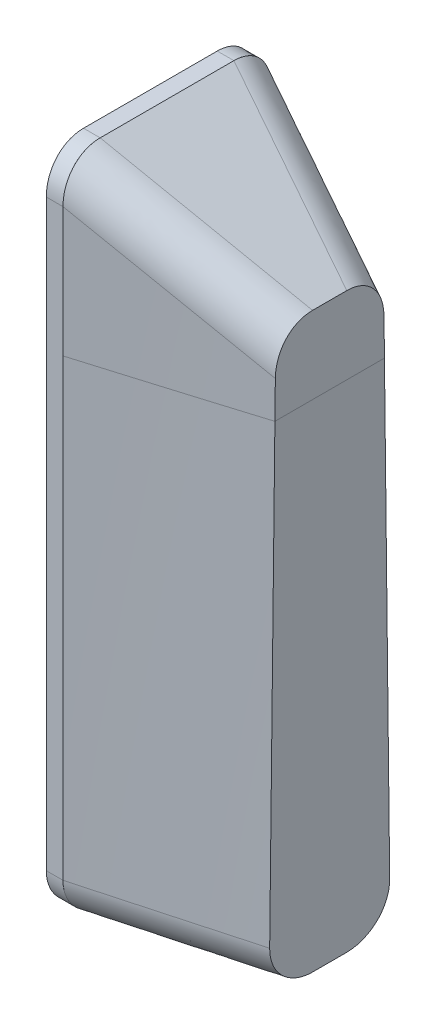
ISO-10303-21;
HEADER;
FILE_DESCRIPTION(('STEP AP214'),'2;1');
FILE_NAME('part.step','',(''),(''),'','','');
FILE_SCHEMA(('AUTOMOTIVE_DESIGN { 1 0 10303 214 1 1 1 1 }'));
ENDSEC;
DATA;
#1=APPLICATION_CONTEXT('core data for automotive mechanical design processes');
#2=APPLICATION_PROTOCOL_DEFINITION('international standard','automotive_design',2000,#1);
#3=PRODUCT_CONTEXT('',#1,'mechanical');
#4=PRODUCT('Part','Part','',(#3));
#5=PRODUCT_RELATED_PRODUCT_CATEGORY('part','',(#4));
#6=PRODUCT_DEFINITION_FORMATION('','',#4);
#7=PRODUCT_DEFINITION_CONTEXT('part definition',#1,'design');
#8=PRODUCT_DEFINITION('design','',#6,#7);
#9=PRODUCT_DEFINITION_SHAPE('','',#8);
#10=(LENGTH_UNIT() NAMED_UNIT(*) SI_UNIT(.MILLI.,.METRE.));
#11=(NAMED_UNIT(*) PLANE_ANGLE_UNIT() SI_UNIT($,.RADIAN.));
#12=(NAMED_UNIT(*) SI_UNIT($,.STERADIAN.) SOLID_ANGLE_UNIT());
#13=UNCERTAINTY_MEASURE_WITH_UNIT(LENGTH_MEASURE(1.E-05),#10,'distance_accuracy_value','');
#14=(GEOMETRIC_REPRESENTATION_CONTEXT(3) GLOBAL_UNCERTAINTY_ASSIGNED_CONTEXT((#13)) GLOBAL_UNIT_ASSIGNED_CONTEXT((#10,
#11,#12)) REPRESENTATION_CONTEXT('',''));
#15=CARTESIAN_POINT('',(0.,0.,0.));
#16=DIRECTION('',(0.,0.,1.));
#17=DIRECTION('',(1.,0.,0.));
#18=AXIS2_PLACEMENT_3D('',#15,#16,#17);
#19=CARTESIAN_POINT('',(0.,119.10399609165,-25.570067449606));
#20=DIRECTION('',(0.,-1.,0.));
#21=DIRECTION('',(0.,0.,-1.));
#22=AXIS2_PLACEMENT_3D('',#19,#20,#21);
#23=PLANE('',#22);
#24=CARTESIAN_POINT('',(39.0699557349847,119.10399609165,-13.1565904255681));
#25=CARTESIAN_POINT('',(37.215246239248,119.10399609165,-13.7293949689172));
#26=CARTESIAN_POINT('',(35.3600451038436,119.10399609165,-14.3006063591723));
#27=CARTESIAN_POINT('',(31.6487247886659,119.10399609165,-15.4400346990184));
#28=CARTESIAN_POINT('',(29.7926056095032,119.10399609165,-16.008251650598));
#29=CARTESIAN_POINT('',(26.079512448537,119.10399609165,-17.1418835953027));
#30=CARTESIAN_POINT('',(24.2225384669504,119.10399609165,-17.7072985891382));
#31=CARTESIAN_POINT('',(20.5077910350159,119.10399609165,-18.8354985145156));
#32=CARTESIAN_POINT('',(18.6500175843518,119.10399609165,-19.3982834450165));
#33=CARTESIAN_POINT('',(13.994811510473,119.10399609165,-20.8051346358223));
#34=CARTESIAN_POINT('',(11.1969067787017,119.10399609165,-21.6476387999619));
#35=CARTESIAN_POINT('',(5.59956452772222,119.10399609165,-23.3275341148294));
#36=CARTESIAN_POINT('',(2.80012700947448,119.10399609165,-24.1649252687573));
#37=CARTESIAN_POINT('',(0.,119.10399609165,-25.));
#38=B_SPLINE_CURVE_WITH_KNOTS('',3,(#24,#25,#26,#27,#28,#29,#30,#31,#32,#33,#34,#35,#36,#37),
.UNSPECIFIED.,.F.,.F.,(4,2,2,2,2,2,4),(0.,5.82344027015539,11.6468766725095,17.4703115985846,
23.2937488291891,32.0597435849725,40.8257328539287),.UNSPECIFIED.);
#39=CARTESIAN_POINT('',(39.0699557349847,119.10399609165,-13.1565904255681));
#40=VERTEX_POINT('',#39);
#41=CARTESIAN_POINT('',(0.,119.10399609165,-25.));
#42=VERTEX_POINT('',#41);
#43=EDGE_CURVE('E131',#40,#42,#38,.T.);
#44=ORIENTED_EDGE('',*,*,#43,.F.);
#45=DIRECTION('',(0.,0.,-1.));
#46=VECTOR('',#45,1.);
#47=CARTESIAN_POINT('',(39.0699557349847,119.10399609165,-12.9422863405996));
#48=LINE('',#47,#46);
#49=CARTESIAN_POINT('',(39.0699557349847,119.10399609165,13.1565904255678));
#50=VERTEX_POINT('',#49);
#51=EDGE_CURVE('E329',#50,#40,#48,.T.);
#52=ORIENTED_EDGE('',*,*,#51,.F.);
#53=CARTESIAN_POINT('',(0.,119.10399609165,25.));
#54=CARTESIAN_POINT('',(1.86018533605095,119.10399609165,24.4452471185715));
#55=CARTESIAN_POINT('',(3.72006445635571,119.10399609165,23.889466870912));
#56=CARTESIAN_POINT('',(7.43916829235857,119.10399609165,22.7757182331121));
#57=CARTESIAN_POINT('',(9.29839300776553,119.10399609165,22.2177498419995));
#58=CARTESIAN_POINT('',(13.01614463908,119.10399609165,21.0994919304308));
#59=CARTESIAN_POINT('',(14.8746715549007,119.10399609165,20.5392024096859));
#60=CARTESIAN_POINT('',(18.5909786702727,119.10399609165,19.416154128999));
#61=CARTESIAN_POINT('',(20.4487588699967,119.10399609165,18.8533953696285));
#62=CARTESIAN_POINT('',(25.1020502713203,119.10399609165,17.4402300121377));
#63=CARTESIAN_POINT('',(27.8970572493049,119.10399609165,16.5881619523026));
#64=CARTESIAN_POINT('',(33.4850641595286,119.10399609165,14.8774572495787));
#65=CARTESIAN_POINT('',(36.2780640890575,119.10399609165,14.0188205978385));
#66=CARTESIAN_POINT('',(39.0699557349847,119.10399609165,13.1565904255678));
#67=B_SPLINE_CURVE_WITH_KNOTS('',3,(#53,#54,#55,#56,#57,#58,#59,#60,#61,#62,#63,#64,#65,#66),
.UNSPECIFIED.,.F.,.F.,(4,2,2,2,2,2,4),(0.,5.82343210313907,11.6468667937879,17.4703022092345,
23.2937362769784,32.0597282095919,40.825731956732),.UNSPECIFIED.);
#68=CARTESIAN_POINT('',(0.,119.10399609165,25.));
#69=VERTEX_POINT('',#68);
#70=EDGE_CURVE('E139',#69,#50,#67,.T.);
#71=ORIENTED_EDGE('',*,*,#70,.F.);
#72=DIRECTION('',(0.,0.,1.));
#73=VECTOR('',#72,1.);
#74=CARTESIAN_POINT('',(0.,119.10399609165,25.));
#75=LINE('',#74,#73);
#76=EDGE_CURVE('E140',#42,#69,#75,.T.);
#77=ORIENTED_EDGE('',*,*,#76,.F.);
#78=EDGE_LOOP('',(#44,#52,#71,#77));
#79=FACE_BOUND('',#78,.T.);
#80=ADVANCED_FACE('F69',(#79),#23,.T.);
#81=CARTESIAN_POINT('',(0.,160.,25.));
#82=DIRECTION('',(-1.,0.,0.));
#83=DIRECTION('',(0.,0.,-1.));
#84=AXIS2_PLACEMENT_3D('',#81,#82,#83);
#85=PLANE('',#84);
#86=DIRECTION('',(0.,-1.,0.));
#87=VECTOR('',#86,1.);
#88=CARTESIAN_POINT('',(0.,80.,-25.));
#89=LINE('',#88,#87);
#90=CARTESIAN_POINT('',(0.,150.154991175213,-25.));
#91=VERTEX_POINT('',#90);
#92=EDGE_CURVE('E135',#91,#42,#89,.T.);
#93=ORIENTED_EDGE('',*,*,#92,.T.);
#94=ORIENTED_EDGE('',*,*,#76,.T.);
#95=DIRECTION('',(0.,1.,0.));
#96=VECTOR('',#95,1.);
#97=CARTESIAN_POINT('',(0.,80.,25.));
#98=LINE('',#97,#96);
#99=CARTESIAN_POINT('',(0.,150.154991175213,25.));
#100=VERTEX_POINT('',#99);
#101=EDGE_CURVE('E149',#69,#100,#98,.T.);
#102=ORIENTED_EDGE('',*,*,#101,.T.);
#103=CARTESIAN_POINT('',(-13.9152250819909,158.066601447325,29.2611862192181));
#104=CARTESIAN_POINT('',(-9.9306901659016,165.675261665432,28.0738819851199));
#105=CARTESIAN_POINT('',(-11.8656191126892,166.781048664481,19.6946692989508));
#106=CARTESIAN_POINT('',(-11.5961859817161,156.747772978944,28.550792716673));
#107=CARTESIAN_POINT('',(-7.61599398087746,164.352442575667,27.3596525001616));
#108=CARTESIAN_POINT('',(-9.54895712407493,165.457106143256,18.9849816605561));
#109=CARTESIAN_POINT('',(-9.27706434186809,155.429057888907,27.8404971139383));
#110=CARTESIAN_POINT('',(-5.3006369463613,163.029245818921,26.6452235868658));
#111=CARTESIAN_POINT('',(-7.23226743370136,164.133147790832,18.2754140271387));
#112=CARTESIAN_POINT('',(-4.63865598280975,152.791854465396,26.4201017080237));
#113=CARTESIAN_POINT('',(-0.669879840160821,160.38282771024,25.2163614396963));
#114=CARTESIAN_POINT('',(-2.59883264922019,161.485199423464,16.8565187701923));
#115=CARTESIAN_POINT('',(-2.31936926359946,151.473366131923,25.7100019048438));
#116=CARTESIAN_POINT('',(1.64546471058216,159.059638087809,24.5019453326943));
#117=CARTESIAN_POINT('',(-0.282087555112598,160.161209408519,16.1471911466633));
#118=CARTESIAN_POINT('',(-4.81582611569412E-09,150.154991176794,25.0000000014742));
#119=CARTESIAN_POINT('',(3.96133038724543,157.736150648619,23.7873728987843));
#120=CARTESIAN_POINT('',(2.03468524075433,158.837203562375,15.4379835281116));
#121=CARTESIAN_POINT('',(0.278768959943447,149.996534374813,24.9146643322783));
#122=CARTESIAN_POINT('',(4.23960374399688,157.577121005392,23.7015102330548));
#123=CARTESIAN_POINT('',(2.31314183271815,158.678069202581,15.3527434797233));
#124=CARTESIAN_POINT('',(0.557539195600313,149.838079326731,24.8293301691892));
#125=CARTESIAN_POINT('',(4.51788587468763,157.418086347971,23.6156449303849));
#126=CARTESIAN_POINT('',(2.59159885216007,158.518934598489,15.2675052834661));
#127=CARTESIAN_POINT('',(5.75387106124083,146.884492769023,23.2387202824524));
#128=CARTESIAN_POINT('',(9.70227806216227,154.455272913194,22.0159768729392));
#129=CARTESIAN_POINT('',(7.78207646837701,155.552643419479,13.6786907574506));
#130=CARTESIAN_POINT('',(10.67183054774,144.089910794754,21.7339159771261));
#131=CARTESIAN_POINT('',(14.6108651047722,151.650078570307,20.5014318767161));
#132=CARTESIAN_POINT('',(12.6942309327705,152.745410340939,12.1756944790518));
#133=CARTESIAN_POINT('',(18.8692024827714,139.433356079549,19.226822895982));
#134=CARTESIAN_POINT('',(22.7940417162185,146.97349841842,17.9765566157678));
#135=CARTESIAN_POINT('',(20.8814161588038,148.066539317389,9.67183491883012));
#136=CARTESIAN_POINT('',(22.1483572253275,137.571022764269,18.2242294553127));
#137=CARTESIAN_POINT('',(26.0664924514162,145.103334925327,16.9668713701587));
#138=CARTESIAN_POINT('',(24.1563597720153,146.194951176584,8.67059359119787));
#139=CARTESIAN_POINT('',(28.7071244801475,133.847002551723,16.2195827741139));
#140=CARTESIAN_POINT('',(32.6115621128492,141.362911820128,14.9474762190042));
#141=CARTESIAN_POINT('',(30.7064024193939,142.451686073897,6.66878551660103));
#142=CARTESIAN_POINT('',(31.9867369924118,131.985315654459,15.2175295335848));
#143=CARTESIAN_POINT('',(35.8839613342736,139.492777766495,13.9378340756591));
#144=CARTESIAN_POINT('',(33.9815014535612,140.580009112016,5.66821876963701));
#145=CARTESIAN_POINT('',(36.5343497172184,129.40454815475,13.8285760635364));
#146=CARTESIAN_POINT('',(40.4227224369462,136.898934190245,12.5374995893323));
#147=CARTESIAN_POINT('',(38.5226229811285,137.984816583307,4.28143365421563));
#148=CARTESIAN_POINT('',(37.8021329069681,128.68515796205,13.4414202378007));
#149=CARTESIAN_POINT('',(41.6876078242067,136.176068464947,12.147249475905));
#150=CARTESIAN_POINT('',(39.7885714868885,137.261343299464,3.89489386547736));
#151=CARTESIAN_POINT('',(39.0699557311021,127.965824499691,13.0543110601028));
#152=CARTESIAN_POINT('',(42.9527410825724,135.453061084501,11.7569253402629));
#153=CARTESIAN_POINT('',(41.0545335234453,136.537862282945,3.50841287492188));
#154=CARTESIAN_POINT('',(40.0760782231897,127.394972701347,12.7471071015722));
#155=CARTESIAN_POINT('',(43.9563680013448,134.879501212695,11.44728217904));
#156=CARTESIAN_POINT('',(42.0591796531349,135.963719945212,3.20170723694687));
#157=CARTESIAN_POINT('',(41.0822266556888,126.82415818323,12.4399336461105));
#158=CARTESIAN_POINT('',(44.960161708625,134.305846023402,11.1375891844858));
#159=CARTESIAN_POINT('',(43.0638346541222,135.389572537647,2.89504015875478));
#160=CARTESIAN_POINT('',(43.0945754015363,125.682603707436,11.8256477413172));
#161=CARTESIAN_POINT('',(46.9677521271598,133.158533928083,10.5182055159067));
#162=CARTESIAN_POINT('',(45.0731623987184,134.241267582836,2.28178312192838));
#163=CARTESIAN_POINT('',(44.1007757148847,125.111863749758,11.5185352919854));
#164=CARTESIAN_POINT('',(47.9715411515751,132.584881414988,10.2085172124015));
#165=CARTESIAN_POINT('',(46.0778351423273,133.667110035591,1.97519316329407));
#166=CARTESIAN_POINT('',(45.1070019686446,124.541161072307,11.2114533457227));
#167=CARTESIAN_POINT('',(48.9754775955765,132.011144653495,9.89878504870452));
#168=CARTESIAN_POINT('',(47.0825167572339,133.092947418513,1.66864176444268));
#169=(BOUNDED_SURFACE() B_SPLINE_SURFACE(3,2,((#103,#104,#105),(#106,#107,#108),(#109,#110,
#111),(#112,#113,#114),(#115,#116,#117),(#118,#119,#120),(#121,#122,#123),(#124,#125,#126),
(#127,#128,#129),(#130,#131,#132),(#133,#134,#135),(#136,#137,#138),(#139,#140,#141),(#142,#143,
#144),(#145,#146,#147),(#148,#149,#150),(#151,#152,#153),(#154,#155,#156),(#157,#158,#159),
(#160,#161,#162),(#163,#164,#165),(#166,#167,#168)),.UNSPECIFIED.,.F.,.F.,
.F.) B_SPLINE_SURFACE_WITH_KNOTS((4,2,3,2,2,2,2,3,2,4),(3,3),(0.,8.28315324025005,
16.5663064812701,17.5618712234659,35.1237431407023,46.8316565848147,58.5395700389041,
63.0649506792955,66.6562171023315,70.247483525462),(0.,1.),
.UNSPECIFIED.) GEOMETRIC_REPRESENTATION_ITEM() RATIONAL_B_SPLINE_SURFACE(((1.,0.755544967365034,
1.),(1.,0.755730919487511,1.),(1.,0.755921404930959,1.),(1.,0.756311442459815,1.),(1.,
0.756510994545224,1.),(1.,0.756715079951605,1.),(1.,0.756739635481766,1.),(1.,0.756764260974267,
1.),(1.,0.757224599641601,1.),(1.,0.757682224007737,1.),(1.,0.758487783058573,1.),(1.,
0.758821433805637,1.),(1.,0.759514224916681,1.),(1.,0.759873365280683,1.),(1.,0.760391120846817,
1.),(1.,0.760537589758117,1.),(1.,0.760686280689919,1.),(1.,0.760804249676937,1.),(1.,
0.760923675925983,1.),(1.,0.761165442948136,1.),(1.,0.761287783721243,1.),(1.,0.761411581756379,1.))) REPRESENTATION_ITEM('') SURFACE());
#170=CARTESIAN_POINT('',(0.,150.154991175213,25.));
#171=CARTESIAN_POINT('',(0.,150.463937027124,25.0000077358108));
#172=CARTESIAN_POINT('',(0.,150.772959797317,24.9884697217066));
#173=CARTESIAN_POINT('',(0.,151.389411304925,24.9414954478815));
#174=CARTESIAN_POINT('',(0.,151.696838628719,24.9060407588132));
#175=CARTESIAN_POINT('',(0.,152.310284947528,24.8100458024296));
#176=CARTESIAN_POINT('',(0.,152.616273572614,24.7493093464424));
#177=CARTESIAN_POINT('',(0.,153.221942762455,24.6020479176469));
#178=CARTESIAN_POINT('',(0.,153.521624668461,24.5155284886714));
#179=CARTESIAN_POINT('',(0.,154.113697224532,24.3156388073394));
#180=CARTESIAN_POINT('',(0.,154.406041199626,24.2021296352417));
#181=CARTESIAN_POINT('',(0.,154.978806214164,23.9482387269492));
#182=CARTESIAN_POINT('',(0.,155.259229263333,23.8078615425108));
#183=CARTESIAN_POINT('',(0.,155.804155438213,23.5008094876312));
#184=CARTESIAN_POINT('',(0.,156.068706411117,23.3342197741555));
#185=CARTESIAN_POINT('',(0.,156.579496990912,22.9750091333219));
#186=CARTESIAN_POINT('',(0.,156.825740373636,22.7823935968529));
#187=CARTESIAN_POINT('',(0.,157.265911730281,22.3990246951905));
#188=CARTESIAN_POINT('',(0.,157.462476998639,22.2112934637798));
#189=CARTESIAN_POINT('',(0.,157.837105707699,21.8181863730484));
#190=CARTESIAN_POINT('',(0.,158.015170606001,21.612811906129));
#191=CARTESIAN_POINT('',(0.,158.350842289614,21.1859528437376));
#192=CARTESIAN_POINT('',(0.,158.508448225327,20.9644675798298));
#193=CARTESIAN_POINT('',(0.,158.801486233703,20.5072978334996));
#194=CARTESIAN_POINT('',(0.,158.936920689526,20.2716148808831));
#195=CARTESIAN_POINT('',(0.,159.170184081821,19.8158247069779));
#196=CARTESIAN_POINT('',(0.,159.270540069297,19.5970055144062));
#197=CARTESIAN_POINT('',(0.,159.452170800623,19.1515886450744));
#198=CARTESIAN_POINT('',(0.,159.53344609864,18.92499119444));
#199=CARTESIAN_POINT('',(0.,159.67648914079,18.4659025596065));
#200=CARTESIAN_POINT('',(0.,159.738270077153,18.233415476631));
#201=CARTESIAN_POINT('',(0.,159.842281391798,17.764190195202));
#202=CARTESIAN_POINT('',(0.,159.884518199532,17.5274534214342));
#203=CARTESIAN_POINT('',(0.,159.944921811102,17.0856746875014));
#204=CARTESIAN_POINT('',(0.,159.965679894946,16.8809807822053));
#205=CARTESIAN_POINT('',(0.,159.993210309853,16.4711420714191));
#206=CARTESIAN_POINT('',(0.,160.000015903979,16.2659995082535));
#207=CARTESIAN_POINT('',(0.,160.,16.0608686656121));
#208=B_SPLINE_CURVE_WITH_KNOTS('',3,(#170,#171,#172,#173,#174,#175,#176,#177,#178,#179,#180,
#181,#182,#183,#184,#185,#186,#187,#188,#189,#190,#191,#192,#193,#194,#195,#196,#197,#198,#199,
#200,#201,#202,#203,#204,#205,#206,#207),.UNSPECIFIED.,.F.,.F.,(4,2,2,2,2,2,2,2,2,2,2,2,2,2,2,2,
2,2,4),(0.,0.926737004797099,1.85418893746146,2.78897626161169,3.72356273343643,
4.66306794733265,5.60241413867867,6.53876938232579,7.4749309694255,8.28921668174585,
9.10343818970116,9.91769349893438,10.7318612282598,11.45319833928,12.1745144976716,
12.8953414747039,13.6159311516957,14.2326940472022,14.8479848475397),.UNSPECIFIED.);
#209=CARTESIAN_POINT('',(0.,160.,16.0608686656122));
#210=VERTEX_POINT('',#209);
#211=EDGE_CURVE('E322',#100,#210,#208,.T.);
#212=ORIENTED_EDGE('',*,*,#211,.T.);
#213=DIRECTION('',(0.,0.,-1.));
#214=VECTOR('',#213,1.);
#215=CARTESIAN_POINT('',(0.,160.,0.));
#216=LINE('',#215,#214);
#217=CARTESIAN_POINT('',(0.,160.,0.));
#218=VERTEX_POINT('',#217);
#219=EDGE_CURVE('E86',#210,#218,#216,.T.);
#220=ORIENTED_EDGE('',*,*,#219,.T.);
#221=DIRECTION('',(0.,0.,-1.));
#222=VECTOR('',#221,1.);
#223=CARTESIAN_POINT('',(0.,160.,0.));
#224=LINE('',#223,#222);
#225=CARTESIAN_POINT('',(0.,160.,-16.0608686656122));
#226=VERTEX_POINT('',#225);
#227=EDGE_CURVE('E13',#218,#226,#224,.T.);
#228=ORIENTED_EDGE('',*,*,#227,.T.);
#229=CARTESIAN_POINT('',(-11.8506608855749,166.772500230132,-19.690087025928));
#230=CARTESIAN_POINT('',(-9.9157404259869,165.666718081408,-28.0692690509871));
#231=CARTESIAN_POINT('',(-13.9002514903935,158.05808607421,-29.2565993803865));
#232=CARTESIAN_POINT('',(-9.53649181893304,165.449982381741,-18.9811635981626));
#233=CARTESIAN_POINT('',(-7.60353445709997,164.345322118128,-27.3558079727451));
#234=CARTESIAN_POINT('',(-11.5837076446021,156.740677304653,-28.5469707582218));
#235=CARTESIAN_POINT('',(-7.22229510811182,164.127448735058,-18.2723599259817));
#236=CARTESIAN_POINT('',(-5.29066910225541,163.023549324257,-26.6421479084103));
#237=CARTESIAN_POINT('',(-9.26708143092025,155.423381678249,-27.8374398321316));
#238=CARTESIAN_POINT('',(-2.59384639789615,161.482349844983,-16.854992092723));
#239=CARTESIAN_POINT('',(-0.664895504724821,160.379979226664,-25.2148234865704));
#240=CARTESIAN_POINT('',(-4.63366426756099,152.789016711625,-26.418573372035));
#241=CARTESIAN_POINT('',(-0.2795943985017,160.159784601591,-16.1464279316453));
#242=CARTESIAN_POINT('',(1.64795739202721,159.058213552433,-24.5011762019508));
#243=CARTESIAN_POINT('',(-2.31687331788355,151.471947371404,-25.7092378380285));
#244=CARTESIAN_POINT('',(2.03468524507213,158.837203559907,-15.4379835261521));
#245=CARTESIAN_POINT('',(3.96133039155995,157.736150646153,-23.7873728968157));
#246=CARTESIAN_POINT('',(-3.15662584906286E-10,150.154991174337,-25.0000000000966));
#247=CARTESIAN_POINT('',(2.31563499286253,158.676644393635,-15.3519802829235));
#248=CARTESIAN_POINT('',(4.24209518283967,157.575697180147,-23.700741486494));
#249=CARTESIAN_POINT('',(0.281264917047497,149.995115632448,-24.9139002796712));
#250=CARTESIAN_POINT('',(2.59658517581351,158.516084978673,-15.2659789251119));
#251=CARTESIAN_POINT('',(4.52286890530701,157.415238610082,-23.6141073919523));
#252=CARTESIAN_POINT('',(0.562531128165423,149.835241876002,-24.827802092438));
#253=CARTESIAN_POINT('',(7.78706293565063,155.549793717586,-13.6771650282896));
#254=CARTESIAN_POINT('',(9.70726393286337,154.452423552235,-22.0144384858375));
#255=CARTESIAN_POINT('',(5.75886342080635,146.881655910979,-23.237192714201));
#256=CARTESIAN_POINT('',(12.6967242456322,152.743985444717,-12.1749319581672));
#257=CARTESIAN_POINT('',(14.6133598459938,151.648652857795,-20.5006621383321));
#258=CARTESIAN_POINT('',(10.6743269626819,144.08849269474,-21.7331524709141));
#259=CARTESIAN_POINT('',(20.8797539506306,148.067489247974,-9.67234326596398));
#260=CARTESIAN_POINT('',(22.7923820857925,146.974446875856,-17.9770686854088));
#261=CARTESIAN_POINT('',(18.8675382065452,139.43430147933,-19.2273319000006));
#262=CARTESIAN_POINT('',(24.1530352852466,146.196851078,-8.67160997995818));
#263=CARTESIAN_POINT('',(26.0631719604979,145.105232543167,-16.9678958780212));
#264=CARTESIAN_POINT('',(22.1450284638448,137.57291327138,-18.2252472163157));
#265=CARTESIAN_POINT('',(30.6997532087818,142.455486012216,-6.67081726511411));
#266=CARTESIAN_POINT('',(32.604919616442,141.366707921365,-14.949525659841));
#267=CARTESIAN_POINT('',(28.7004662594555,133.850782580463,-16.2216174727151));
#268=CARTESIAN_POINT('',(33.973189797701,140.584759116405,-5.67075783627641));
#269=CARTESIAN_POINT('',(35.8756580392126,139.497522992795,-13.9403959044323));
#270=CARTESIAN_POINT('',(31.9784137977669,131.990040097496,-15.2200724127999));
#271=CARTESIAN_POINT('',(38.5159734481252,137.988616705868,-4.28346399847));
#272=CARTESIAN_POINT('',(40.4160772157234,136.902731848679,-12.5395498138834));
#273=CARTESIAN_POINT('',(36.5276905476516,129.408326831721,-13.8306096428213));
#274=CARTESIAN_POINT('',(39.7852466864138,137.26324338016,-3.8959088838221));
#275=CARTESIAN_POINT('',(41.6842845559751,136.177967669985,-12.1482747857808));
#276=CARTESIAN_POINT('',(37.7988032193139,128.687047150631,-13.4424369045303));
#277=CARTESIAN_POINT('',(41.0545335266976,136.537862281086,-3.50841287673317));
#278=CARTESIAN_POINT('',(42.952741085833,135.453061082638,-11.7569253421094));
#279=CARTESIAN_POINT('',(39.0699557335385,127.965824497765,-13.0543110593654));
#280=CARTESIAN_POINT('',(42.0566860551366,135.965145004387,-3.20246850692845));
#281=CARTESIAN_POINT('',(43.9538773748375,134.8809245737,-11.4480505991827));
#282=CARTESIAN_POINT('',(40.0735809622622,127.396389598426,-12.7478696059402));
#283=CARTESIAN_POINT('',(43.0588474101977,135.392422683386,-2.89656250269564));
#284=CARTESIAN_POINT('',(44.9551795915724,134.308693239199,-11.1391262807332));
#285=CARTESIAN_POINT('',(41.0772320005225,126.826991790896,-12.4414585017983));
#286=CARTESIAN_POINT('',(45.0631877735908,134.246967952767,-2.28482722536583));
#287=CARTESIAN_POINT('',(46.9577869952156,133.164228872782,-10.5212799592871));
#288=CARTESIAN_POINT('',(43.0845856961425,125.688270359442,-11.8286969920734));
#289=CARTESIAN_POINT('',(46.0653667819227,133.674235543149,-1.97899795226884));
#290=CARTESIAN_POINT('',(47.9590845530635,132.592000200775,-10.2123603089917));
#291=CARTESIAN_POINT('',(44.0882883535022,125.118946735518,-11.5223465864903));
#292=CARTESIAN_POINT('',(47.0675546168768,133.10149808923,-1.67320704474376));
#293=CARTESIAN_POINT('',(48.960528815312,132.019687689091,-9.90339701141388));
#294=CARTESIAN_POINT('',(45.0920168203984,124.549660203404,-11.2160265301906));
#295=(BOUNDED_SURFACE() B_SPLINE_SURFACE(3,2,((#229,#230,#231),(#232,#233,#234),(#235,#236,
#237),(#238,#239,#240),(#241,#242,#243),(#244,#245,#246),(#247,#248,#249),(#250,#251,#252),
(#253,#254,#255),(#256,#257,#258),(#259,#260,#261),(#262,#263,#264),(#265,#266,#267),(#268,#269,
#270),(#271,#272,#273),(#274,#275,#276),(#277,#278,#279),(#280,#281,#282),(#283,#284,#285),
(#286,#287,#288),(#289,#290,#291),(#292,#293,#294)),.UNSPECIFIED.,.F.,.F.,
.F.) B_SPLINE_SURFACE_WITH_KNOTS((4,2,3,2,2,2,2,3,2,4),(3,3),(0.,8.27423946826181,
16.5484789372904,17.5529574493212,35.1059155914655,46.8078865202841,58.5098574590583,
63.0471231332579,66.6294757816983,70.2118284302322),(0.,1.),
.UNSPECIFIED.) GEOMETRIC_REPRESENTATION_ITEM() RATIONAL_B_SPLINE_SURFACE(((1.,0.755546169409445,
1.),(1.,0.75573194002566,1.),(1.,0.755922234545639,1.),(1.,0.756311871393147,1.),(1.,
0.756511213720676,1.),(1.,0.75671507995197,1.),(1.,0.756739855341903,1.),(1.,0.756764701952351,
1.),(1.,0.757225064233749,1.),(1.,0.757682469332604,1.),(1.,0.758487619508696,1.),(1.,
0.758821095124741,1.),(1.,0.759513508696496,1.),(1.,0.75987244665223,1.),(1.,0.760390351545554,
1.),(1.,0.760537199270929,1.),(1.,0.760686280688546,1.),(1.,0.760803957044,1.),(1.,
0.760923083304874,1.),(1.,0.761164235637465,1.),(1.,0.761286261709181,1.),(1.,0.761409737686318,1.))) REPRESENTATION_ITEM('') SURFACE());
#296=CARTESIAN_POINT('',(0.,160.,-16.0608686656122));
#297=CARTESIAN_POINT('',(0.,160.000035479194,-16.3035735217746));
#298=CARTESIAN_POINT('',(0.,159.990495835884,-16.5463220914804));
#299=CARTESIAN_POINT('',(0.,159.951906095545,-17.0303459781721));
#300=CARTESIAN_POINT('',(0.,159.92284889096,-17.2716207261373));
#301=CARTESIAN_POINT('',(0.,159.844852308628,-17.7510244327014));
#302=CARTESIAN_POINT('',(0.,159.795907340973,-17.9891524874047));
#303=CARTESIAN_POINT('',(0.,159.678080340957,-18.4603973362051));
#304=CARTESIAN_POINT('',(0.,159.609201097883,-18.6935148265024));
#305=CARTESIAN_POINT('',(0.,159.451494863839,-19.1535870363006));
#306=CARTESIAN_POINT('',(0.,159.362616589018,-19.3805241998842));
#307=CARTESIAN_POINT('',(0.,159.165501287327,-19.8258285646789));
#308=CARTESIAN_POINT('',(0.,159.057264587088,-20.0441959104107));
#309=CARTESIAN_POINT('',(0.,158.822309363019,-20.4705018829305));
#310=CARTESIAN_POINT('',(0.,158.695606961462,-20.6784493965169));
#311=CARTESIAN_POINT('',(0.,158.424684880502,-21.0825892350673));
#312=CARTESIAN_POINT('',(0.,158.280465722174,-21.2787819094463));
#313=CARTESIAN_POINT('',(0.,157.979955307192,-21.6528855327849));
#314=CARTESIAN_POINT('',(0.,157.824104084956,-21.8311504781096));
#315=CARTESIAN_POINT('',(0.,157.498330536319,-22.1743044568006));
#316=CARTESIAN_POINT('',(0.,157.328408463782,-22.3391937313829));
#317=CARTESIAN_POINT('',(0.,156.975896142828,-22.6548149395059));
#318=CARTESIAN_POINT('',(0.,156.793305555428,-22.8055464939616));
#319=CARTESIAN_POINT('',(0.,156.416844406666,-23.0923255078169));
#320=CARTESIAN_POINT('',(0.,156.222969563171,-23.2283673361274));
#321=CARTESIAN_POINT('',(0.,155.815864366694,-23.4915429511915));
#322=CARTESIAN_POINT('',(0.,155.602151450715,-23.6179297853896));
#323=CARTESIAN_POINT('',(0.,155.165573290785,-23.8539133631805));
#324=CARTESIAN_POINT('',(0.,154.942704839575,-23.9635041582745));
#325=CARTESIAN_POINT('',(0.,154.489223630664,-24.165922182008));
#326=CARTESIAN_POINT('',(0.,154.25860318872,-24.2587321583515));
#327=CARTESIAN_POINT('',(0.,153.791293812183,-24.4275731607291));
#328=CARTESIAN_POINT('',(0.,153.554604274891,-24.5036025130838));
#329=CARTESIAN_POINT('',(0.,153.058541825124,-24.6442122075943));
#330=CARTESIAN_POINT('',(0.,152.798802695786,-24.7074997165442));
#331=CARTESIAN_POINT('',(0.,152.275521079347,-24.8153142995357));
#332=CARTESIAN_POINT('',(0.,152.011979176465,-24.8598442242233));
#333=CARTESIAN_POINT('',(0.,151.483359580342,-24.9305104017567));
#334=CARTESIAN_POINT('',(0.,151.218289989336,-24.9567077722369));
#335=CARTESIAN_POINT('',(0.,150.687129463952,-24.9914499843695));
#336=CARTESIAN_POINT('',(0.,150.421039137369,-25.0000040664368));
#337=CARTESIAN_POINT('',(0.,150.154991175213,-25.));
#338=B_SPLINE_CURVE_WITH_KNOTS('',3,(#296,#297,#298,#299,#300,#301,#302,#303,#304,#305,#306,
#307,#308,#309,#310,#311,#312,#313,#314,#315,#316,#317,#318,#319,#320,#321,#322,#323,#324,#325,
#326,#327,#328,#329,#330,#331,#332,#333,#334,#335,#336,#337),.UNSPECIFIED.,.F.,.F.,(4,2,2,2,2,2,
2,2,2,2,2,2,2,2,2,2,2,2,2,2,4),(0.,0.727991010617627,1.45624727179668,2.184708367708,
2.91306758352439,3.643316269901,4.37355263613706,5.10315521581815,5.83273609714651,
6.54229050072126,7.25183210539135,7.96139270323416,8.67122434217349,9.41531906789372,
10.159676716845,10.9047953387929,11.6499882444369,12.4512821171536,13.2524541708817,
14.0509423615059,14.8490122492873),.UNSPECIFIED.);
#339=EDGE_CURVE('E148',#226,#91,#338,.T.);
#340=ORIENTED_EDGE('',*,*,#339,.T.);
#341=EDGE_LOOP('',(#93,#94,#102,#212,#220,#228,#340));
#342=FACE_BOUND('',#341,.T.);
#343=ADVANCED_FACE('F146',(#342),#85,.T.);
#344=CARTESIAN_POINT('',(39.0699557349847,137.672022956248,4.11432857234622));
#345=CARTESIAN_POINT('',(39.0699557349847,137.672058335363,4.35702784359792));
#346=CARTESIAN_POINT('',(39.0699557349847,137.662515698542,4.59977073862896));
#347=CARTESIAN_POINT('',(39.0699557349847,137.623915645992,5.08378218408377));
#348=CARTESIAN_POINT('',(39.0699557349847,137.594851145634,5.32505016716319));
#349=CARTESIAN_POINT('',(39.0699557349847,137.516837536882,5.80443633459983));
#350=CARTESIAN_POINT('',(39.0699557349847,137.467883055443,6.04255364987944));
#351=CARTESIAN_POINT('',(39.0699557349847,137.350037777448,6.51377623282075));
#352=CARTESIAN_POINT('',(39.0699557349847,137.281149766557,6.74688219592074));
#353=CARTESIAN_POINT('',(39.0699557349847,137.123426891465,7.20692836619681));
#354=CARTESIAN_POINT('',(39.0699557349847,137.034540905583,7.43385106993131));
#355=CARTESIAN_POINT('',(39.0699557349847,136.837415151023,7.87912774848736));
#356=CARTESIAN_POINT('',(39.0699557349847,136.729175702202,8.0974818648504));
#357=CARTESIAN_POINT('',(39.0699557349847,136.494219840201,8.52376299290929));
#358=CARTESIAN_POINT('',(39.0699557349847,136.367519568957,8.7316989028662));
#359=CARTESIAN_POINT('',(39.0699557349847,136.096609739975,9.13582083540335));
#360=CARTESIAN_POINT('',(39.0699557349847,135.9524007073,9.33200721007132));
#361=CARTESIAN_POINT('',(39.0699557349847,135.651884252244,9.70613981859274));
#362=CARTESIAN_POINT('',(39.0699557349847,135.496013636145,9.8844374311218));
#363=CARTESIAN_POINT('',(39.0699557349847,135.17020326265,10.2276599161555));
#364=CARTESIAN_POINT('',(39.0699557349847,135.000263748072,10.3925850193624));
#365=CARTESIAN_POINT('',(39.0699557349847,134.647712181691,10.7082833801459));
#366=CARTESIAN_POINT('',(39.0699557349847,134.465099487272,10.8590559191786));
#367=CARTESIAN_POINT('',(39.0699557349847,134.088595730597,11.1459212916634));
#368=CARTESIAN_POINT('',(39.0699557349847,133.894700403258,11.2820085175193));
#369=CARTESIAN_POINT('',(39.0699557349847,133.487490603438,11.5453159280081));
#370=CARTESIAN_POINT('',(39.0699557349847,133.27369034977,11.6717843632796));
#371=CARTESIAN_POINT('',(39.0699557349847,132.836931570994,11.9079278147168));
#372=CARTESIAN_POINT('',(39.0699557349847,132.613969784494,12.0175967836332));
#373=CARTESIAN_POINT('',(39.0699557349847,132.160350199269,12.220139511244));
#374=CARTESIAN_POINT('',(39.0699557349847,131.929686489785,12.3130000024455));
#375=CARTESIAN_POINT('',(39.0699557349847,131.462222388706,12.4819689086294));
#376=CARTESIAN_POINT('',(39.0699557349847,131.225419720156,12.5580710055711));
#377=CARTESIAN_POINT('',(39.0699557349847,130.740536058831,12.6955818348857));
#378=CARTESIAN_POINT('',(39.0699557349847,130.492324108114,12.7565277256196));
#379=CARTESIAN_POINT('',(39.0699557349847,129.992300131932,12.8612761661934));
#380=CARTESIAN_POINT('',(39.0699557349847,129.740487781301,12.9050771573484));
#381=CARTESIAN_POINT('',(39.0699557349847,129.235419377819,12.9758085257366));
#382=CARTESIAN_POINT('',(39.0699557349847,128.982171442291,13.0027973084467));
#383=CARTESIAN_POINT('',(39.0699557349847,128.474575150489,13.0405785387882));
#384=CARTESIAN_POINT('',(39.0699557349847,128.220227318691,13.0513780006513));
#385=CARTESIAN_POINT('',(39.0699557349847,127.965824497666,13.0543110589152));
#386=B_SPLINE_CURVE_WITH_KNOTS('',3,(#344,#345,#346,#347,#348,#349,#350,#351,#352,#353,#354,
#355,#356,#357,#358,#359,#360,#361,#362,#363,#364,#365,#366,#367,#368,#369,#370,#371,#372,#373,
#374,#375,#376,#377,#378,#379,#380,#381,#382,#383,#384,#385),.UNSPECIFIED.,.F.,.F.,(4,2,2,2,2,2,
2,2,2,2,2,2,2,2,2,2,2,2,2,2,4),(0.,0.727974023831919,1.45621237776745,2.1846475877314,
2.91298104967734,3.6431979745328,4.37340283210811,5.10297299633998,5.83252128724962,
6.54218789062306,7.25184224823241,7.96153261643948,8.67149302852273,9.41593754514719,
10.1606494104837,10.9059465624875,11.6515242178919,12.417653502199,13.1838524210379,
13.9473745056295,14.7105656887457),.UNSPECIFIED.);
#387=CARTESIAN_POINT('',(39.0699557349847,137.672022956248,4.11432857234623));
#388=VERTEX_POINT('',#387);
#389=CARTESIAN_POINT('',(39.0699557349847,127.965824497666,13.0543110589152));
#390=VERTEX_POINT('',#389);
#391=EDGE_CURVE('E171',#388,#390,#386,.T.);
#392=ORIENTED_EDGE('',*,*,#391,.F.);
#393=CARTESIAN_POINT('',(-11.8656191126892,166.781048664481,19.6946692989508));
#394=CARTESIAN_POINT('',(-9.54895712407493,165.457106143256,18.9849816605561));
#395=CARTESIAN_POINT('',(-7.23226743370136,164.133147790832,18.2754140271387));
#396=CARTESIAN_POINT('',(-2.59883264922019,161.485199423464,16.8565187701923));
#397=CARTESIAN_POINT('',(-0.282087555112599,160.161209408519,16.1471911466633));
#398=CARTESIAN_POINT('',(2.03468524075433,158.837203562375,15.4379835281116));
#399=CARTESIAN_POINT('',(2.31314183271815,158.678069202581,15.3527434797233));
#400=CARTESIAN_POINT('',(2.59159885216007,158.518934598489,15.2675052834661));
#401=CARTESIAN_POINT('',(7.78207646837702,155.552643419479,13.6786907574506));
#402=CARTESIAN_POINT('',(12.6942309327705,152.745410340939,12.1756944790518));
#403=CARTESIAN_POINT('',(20.8814161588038,148.066539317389,9.67183491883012));
#404=CARTESIAN_POINT('',(24.1563597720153,146.194951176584,8.67059359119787));
#405=CARTESIAN_POINT('',(30.7064024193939,142.451686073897,6.66878551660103));
#406=CARTESIAN_POINT('',(33.9815014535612,140.580009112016,5.66821876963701));
#407=CARTESIAN_POINT('',(38.5226229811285,137.984816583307,4.28143365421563));
#408=CARTESIAN_POINT('',(39.7885714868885,137.261343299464,3.89489386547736));
#409=CARTESIAN_POINT('',(41.0545335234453,136.537862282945,3.50841287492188));
#410=CARTESIAN_POINT('',(42.0591796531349,135.963719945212,3.20170723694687));
#411=CARTESIAN_POINT('',(43.0638346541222,135.389572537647,2.89504015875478));
#412=CARTESIAN_POINT('',(45.0731623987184,134.241267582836,2.28178312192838));
#413=CARTESIAN_POINT('',(46.0778351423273,133.667110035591,1.97519316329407));
#414=CARTESIAN_POINT('',(47.0825167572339,133.092947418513,1.66864176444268));
#415=B_SPLINE_CURVE_WITH_KNOTS('',3,(#393,#394,#395,#396,#397,#398,#399,#400,#401,#402,#403,
#404,#405,#406,#407,#408,#409,#410,#411,#412,#413,#414),.UNSPECIFIED.,.F.,.F.,(4,2,3,2,2,2,2,3,
2,4),(0.,8.28315324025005,16.5663064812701,17.5618712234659,35.1237431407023,46.8316565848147,
58.5395700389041,63.0649506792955,66.6562171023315,70.247483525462),.UNSPECIFIED.);
#416=EDGE_CURVE('E233',#210,#388,#415,.T.);
#417=ORIENTED_EDGE('',*,*,#416,.F.);
#418=ORIENTED_EDGE('',*,*,#211,.F.);
#419=CARTESIAN_POINT('',(45.1070019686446,124.541161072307,11.2114533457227));
#420=CARTESIAN_POINT('',(44.1007757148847,125.111863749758,11.5185352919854));
#421=CARTESIAN_POINT('',(43.0945754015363,125.682603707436,11.8256477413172));
#422=CARTESIAN_POINT('',(41.0822266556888,126.82415818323,12.4399336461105));
#423=CARTESIAN_POINT('',(40.0760782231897,127.394972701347,12.7471071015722));
#424=CARTESIAN_POINT('',(39.0699557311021,127.965824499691,13.0543110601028));
#425=CARTESIAN_POINT('',(37.8021329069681,128.68515796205,13.4414202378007));
#426=CARTESIAN_POINT('',(36.5343497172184,129.40454815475,13.8285760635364));
#427=CARTESIAN_POINT('',(31.9867369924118,131.985315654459,15.2175295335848));
#428=CARTESIAN_POINT('',(28.7071244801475,133.847002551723,16.2195827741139));
#429=CARTESIAN_POINT('',(22.1483572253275,137.571022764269,18.2242294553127));
#430=CARTESIAN_POINT('',(18.8692024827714,139.433356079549,19.226822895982));
#431=CARTESIAN_POINT('',(10.67183054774,144.089910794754,21.7339159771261));
#432=CARTESIAN_POINT('',(5.75387106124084,146.884492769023,23.2387202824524));
#433=CARTESIAN_POINT('',(0.557539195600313,149.838079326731,24.8293301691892));
#434=CARTESIAN_POINT('',(0.278768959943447,149.996534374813,24.9146643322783));
#435=CARTESIAN_POINT('',(-4.81582611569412E-09,150.154991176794,25.0000000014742));
#436=CARTESIAN_POINT('',(-2.31936926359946,151.473366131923,25.7100019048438));
#437=CARTESIAN_POINT('',(-4.63865598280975,152.791854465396,26.4201017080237));
#438=CARTESIAN_POINT('',(-9.27706434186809,155.429057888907,27.8404971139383));
#439=CARTESIAN_POINT('',(-11.5961859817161,156.747772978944,28.550792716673));
#440=CARTESIAN_POINT('',(-13.9152250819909,158.066601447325,29.2611862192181));
#441=B_SPLINE_CURVE_WITH_KNOTS('',3,(#419,#420,#421,#422,#423,#424,#425,#426,#427,#428,#429,
#430,#431,#432,#433,#434,#435,#436,#437,#438,#439,#440),.UNSPECIFIED.,.F.,.F.,(4,2,3,2,2,2,2,3,
2,4),(0.,3.59126642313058,7.18253284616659,11.707913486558,23.4158269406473,35.1237403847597,
52.6856123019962,53.681177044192,61.964330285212,70.247483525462),.UNSPECIFIED.);
#442=EDGE_CURVE('E238',#390,#100,#441,.T.);
#443=ORIENTED_EDGE('',*,*,#442,.F.);
#444=EDGE_LOOP('',(#392,#417,#418,#443));
#445=FACE_BOUND('',#444,.T.);
#446=ADVANCED_FACE('F197',(#445),#169,.T.);
#447=CARTESIAN_POINT('',(68.9266626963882,120.609299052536,0.));
#448=DIRECTION('',(0.496177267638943,0.868221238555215,0.));
#449=DIRECTION('',(-0.868221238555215,0.496177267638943,0.));
#450=AXIS2_PLACEMENT_3D('',#447,#448,#449);
#451=PLANE('',#450);
#452=DIRECTION('',(0.,0.,1.));
#453=VECTOR('',#452,1.);
#454=CARTESIAN_POINT('',(39.0699557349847,137.672022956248,12.9422863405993));
#455=LINE('',#454,#453);
#456=CARTESIAN_POINT('',(39.0699557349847,137.672022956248,-4.11432857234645));
#457=VERTEX_POINT('',#456);
#458=EDGE_CURVE('E79',#457,#388,#455,.T.);
#459=ORIENTED_EDGE('',*,*,#458,.F.);
#460=CARTESIAN_POINT('',(47.0675546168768,133.10149808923,-1.67320704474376));
#461=CARTESIAN_POINT('',(46.0653667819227,133.674235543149,-1.97899795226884));
#462=CARTESIAN_POINT('',(45.0631877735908,134.246967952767,-2.28482722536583));
#463=CARTESIAN_POINT('',(43.0588474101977,135.392422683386,-2.89656250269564));
#464=CARTESIAN_POINT('',(42.0566860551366,135.965145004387,-3.20246850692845));
#465=CARTESIAN_POINT('',(41.0545335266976,136.537862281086,-3.50841287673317));
#466=CARTESIAN_POINT('',(39.7852466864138,137.26324338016,-3.8959088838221));
#467=CARTESIAN_POINT('',(38.5159734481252,137.988616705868,-4.28346399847));
#468=CARTESIAN_POINT('',(33.973189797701,140.584759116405,-5.67075783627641));
#469=CARTESIAN_POINT('',(30.6997532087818,142.455486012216,-6.67081726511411));
#470=CARTESIAN_POINT('',(24.1530352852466,146.196851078,-8.67160997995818));
#471=CARTESIAN_POINT('',(20.8797539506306,148.067489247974,-9.67234326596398));
#472=CARTESIAN_POINT('',(12.6967242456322,152.743985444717,-12.1749319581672));
#473=CARTESIAN_POINT('',(7.78706293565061,155.549793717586,-13.6771650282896));
#474=CARTESIAN_POINT('',(2.59658517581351,158.516084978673,-15.2659789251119));
#475=CARTESIAN_POINT('',(2.31563499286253,158.676644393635,-15.3519802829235));
#476=CARTESIAN_POINT('',(2.03468524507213,158.837203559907,-15.4379835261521));
#477=CARTESIAN_POINT('',(-0.279594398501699,160.159784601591,-16.1464279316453));
#478=CARTESIAN_POINT('',(-2.59384639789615,161.482349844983,-16.854992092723));
#479=CARTESIAN_POINT('',(-7.22229510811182,164.127448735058,-18.2723599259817));
#480=CARTESIAN_POINT('',(-9.53649181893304,165.449982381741,-18.9811635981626));
#481=CARTESIAN_POINT('',(-11.8506608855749,166.772500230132,-19.690087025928));
#482=B_SPLINE_CURVE_WITH_KNOTS('',3,(#460,#461,#462,#463,#464,#465,#466,#467,#468,#469,#470,
#471,#472,#473,#474,#475,#476,#477,#478,#479,#480,#481),.UNSPECIFIED.,.F.,.F.,(4,2,3,2,2,2,2,3,
2,4),(0.,3.5823526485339,7.16470529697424,11.7019709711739,23.4039419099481,35.1059128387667,
52.658870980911,53.6633494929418,61.9375889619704,70.2118284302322),.UNSPECIFIED.);
#483=EDGE_CURVE('E232',#457,#226,#482,.T.);
#484=ORIENTED_EDGE('',*,*,#483,.T.);
#485=ORIENTED_EDGE('',*,*,#227,.F.);
#486=ORIENTED_EDGE('',*,*,#219,.F.);
#487=ORIENTED_EDGE('',*,*,#416,.T.);
#488=EDGE_LOOP('',(#459,#484,#485,#486,#487));
#489=FACE_BOUND('',#488,.T.);
#490=ADVANCED_FACE('F187',(#489),#451,.T.);
#491=ORIENTED_EDGE('',*,*,#339,.F.);
#492=ORIENTED_EDGE('',*,*,#483,.F.);
#493=CARTESIAN_POINT('',(39.0699557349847,127.965824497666,-13.0543110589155));
#494=CARTESIAN_POINT('',(39.0699557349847,128.272886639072,-13.0507747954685));
#495=CARTESIAN_POINT('',(39.0699557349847,128.579893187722,-13.0357713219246));
#496=CARTESIAN_POINT('',(39.0699557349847,129.192050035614,-12.9820448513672));
#497=CARTESIAN_POINT('',(39.0699557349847,129.497198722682,-12.9433035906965));
#498=CARTESIAN_POINT('',(39.0699557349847,130.105780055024,-12.8409217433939));
#499=CARTESIAN_POINT('',(39.0699557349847,130.409180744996,-12.7770892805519));
#500=CARTESIAN_POINT('',(39.0699557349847,131.009426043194,-12.6238865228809));
#501=CARTESIAN_POINT('',(39.0699557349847,131.306272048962,-12.5345217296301));
#502=CARTESIAN_POINT('',(39.0699557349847,131.892417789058,-12.3292117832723));
#503=CARTESIAN_POINT('',(39.0699557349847,132.181669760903,-12.2131296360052));
#504=CARTESIAN_POINT('',(39.0699557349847,132.748042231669,-11.9544297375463));
#505=CARTESIAN_POINT('',(39.0699557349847,133.025164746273,-11.8118164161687));
#506=CARTESIAN_POINT('',(39.0699557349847,133.563331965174,-11.5006766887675));
#507=CARTESIAN_POINT('',(39.0699557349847,133.824424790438,-11.3322337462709));
#508=CARTESIAN_POINT('',(39.0699557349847,134.328181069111,-10.9697437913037));
#509=CARTESIAN_POINT('',(39.0699557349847,134.570848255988,-10.7757019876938));
#510=CARTESIAN_POINT('',(39.0699557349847,135.004650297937,-10.3897698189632));
#511=CARTESIAN_POINT('',(39.0699557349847,135.198398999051,-10.2008117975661));
#512=CARTESIAN_POINT('',(39.0699557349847,135.567338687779,-9.8055617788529));
#513=CARTESIAN_POINT('',(39.0699557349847,135.7425311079,-9.59927112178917));
#514=CARTESIAN_POINT('',(39.0699557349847,136.072457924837,-9.17089349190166));
#515=CARTESIAN_POINT('',(39.0699557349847,136.227190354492,-8.94880500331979));
#516=CARTESIAN_POINT('',(39.0699557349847,136.51452652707,-8.49076061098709));
#517=CARTESIAN_POINT('',(39.0699557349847,136.647132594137,-8.25480616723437));
#518=CARTESIAN_POINT('',(39.0699557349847,136.875477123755,-7.7981586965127));
#519=CARTESIAN_POINT('',(39.0699557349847,136.973676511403,-7.57869124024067));
#520=CARTESIAN_POINT('',(39.0699557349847,137.150990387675,-7.1321797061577));
#521=CARTESIAN_POINT('',(39.0699557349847,137.230105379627,-6.90513582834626));
#522=CARTESIAN_POINT('',(39.0699557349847,137.368847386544,-6.44537183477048));
#523=CARTESIAN_POINT('',(39.0699557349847,137.428489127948,-6.21265615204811));
#524=CARTESIAN_POINT('',(39.0699557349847,137.528275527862,-5.74316455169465));
#525=CARTESIAN_POINT('',(39.0699557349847,137.568426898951,-5.50639006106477));
#526=CARTESIAN_POINT('',(39.0699557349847,137.623471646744,-5.07687724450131));
#527=CARTESIAN_POINT('',(39.0699557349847,137.6417654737,-4.88456478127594));
#528=CARTESIAN_POINT('',(39.0699557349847,137.666032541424,-4.49960836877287));
#529=CARTESIAN_POINT('',(39.0699557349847,137.672034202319,-4.30696621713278));
#530=CARTESIAN_POINT('',(39.0699557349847,137.672022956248,-4.11432857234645));
#531=B_SPLINE_CURVE_WITH_KNOTS('',3,(#493,#494,#495,#496,#497,#498,#499,#500,#501,#502,#503,
#504,#505,#506,#507,#508,#509,#510,#511,#512,#513,#514,#515,#516,#517,#518,#519,#520,#521,#522,
#523,#524,#525,#526,#527,#528,#529,#530),.UNSPECIFIED.,.F.,.F.,(4,2,2,2,2,2,2,2,2,2,2,2,2,2,2,2,
2,2,4),(0.,0.921148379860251,1.84300637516,2.77205556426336,3.70090471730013,4.63462708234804,
5.56819368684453,6.49880485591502,7.42922695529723,8.23999749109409,9.05070539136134,
9.86149118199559,10.6721917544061,11.3926344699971,12.1130581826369,12.8329358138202,
13.5525653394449,14.1317247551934,14.7095436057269),.UNSPECIFIED.);
#532=CARTESIAN_POINT('',(39.0699557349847,127.965824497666,-13.0543110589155));
#533=VERTEX_POINT('',#532);
#534=EDGE_CURVE('E95',#533,#457,#531,.T.);
#535=ORIENTED_EDGE('',*,*,#534,.F.);
#536=CARTESIAN_POINT('',(-13.9002514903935,158.05808607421,-29.2565993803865));
#537=CARTESIAN_POINT('',(-11.5837076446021,156.740677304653,-28.5469707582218));
#538=CARTESIAN_POINT('',(-9.26708143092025,155.423381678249,-27.8374398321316));
#539=CARTESIAN_POINT('',(-4.63366426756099,152.789016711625,-26.418573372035));
#540=CARTESIAN_POINT('',(-2.31687331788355,151.471947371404,-25.7092378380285));
#541=CARTESIAN_POINT('',(-3.15662584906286E-10,150.154991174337,-25.0000000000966));
#542=CARTESIAN_POINT('',(0.281264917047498,149.995115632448,-24.9139002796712));
#543=CARTESIAN_POINT('',(0.562531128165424,149.835241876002,-24.827802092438));
#544=CARTESIAN_POINT('',(5.75886342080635,146.881655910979,-23.237192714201));
#545=CARTESIAN_POINT('',(10.6743269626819,144.08849269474,-21.7331524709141));
#546=CARTESIAN_POINT('',(18.8675382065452,139.43430147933,-19.2273319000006));
#547=CARTESIAN_POINT('',(22.1450284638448,137.57291327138,-18.2252472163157));
#548=CARTESIAN_POINT('',(28.7004662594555,133.850782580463,-16.2216174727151));
#549=CARTESIAN_POINT('',(31.9784137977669,131.990040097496,-15.2200724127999));
#550=CARTESIAN_POINT('',(36.5276905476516,129.408326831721,-13.8306096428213));
#551=CARTESIAN_POINT('',(37.7988032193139,128.687047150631,-13.4424369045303));
#552=CARTESIAN_POINT('',(39.0699557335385,127.965824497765,-13.0543110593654));
#553=CARTESIAN_POINT('',(40.0735809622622,127.396389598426,-12.7478696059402));
#554=CARTESIAN_POINT('',(41.0772320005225,126.826991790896,-12.4414585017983));
#555=CARTESIAN_POINT('',(43.0845856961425,125.688270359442,-11.8286969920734));
#556=CARTESIAN_POINT('',(44.0882883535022,125.118946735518,-11.5223465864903));
#557=CARTESIAN_POINT('',(45.0920168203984,124.549660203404,-11.2160265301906));
#558=B_SPLINE_CURVE_WITH_KNOTS('',3,(#536,#537,#538,#539,#540,#541,#542,#543,#544,#545,#546,
#547,#548,#549,#550,#551,#552,#553,#554,#555,#556,#557),.UNSPECIFIED.,.F.,.F.,(4,2,3,2,2,2,2,3,
2,4),(0.,8.27423946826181,16.5484789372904,17.5529574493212,35.1059155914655,46.8078865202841,
58.5098574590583,63.0471231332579,66.6294757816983,70.2118284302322),.UNSPECIFIED.);
#559=EDGE_CURVE('E155',#91,#533,#558,.T.);
#560=ORIENTED_EDGE('',*,*,#559,.F.);
#561=EDGE_LOOP('',(#491,#492,#535,#560));
#562=FACE_BOUND('',#561,.T.);
#563=ADVANCED_FACE('F196',(#562),#295,.T.);
#564=CARTESIAN_POINT('',(0.,160.,-25.));
#565=CARTESIAN_POINT('',(0.,0.,-25.));
#566=CARTESIAN_POINT('',(39.0699557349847,137.672022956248,-12.9422863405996));
#567=CARTESIAN_POINT('',(39.0699557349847,0.,-14.531236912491));
#568=B_SPLINE_SURFACE_WITH_KNOTS('',1,1,((#564,#565),(#566,#567)),.UNSPECIFIED.,.F.,.F.,.F.,(2,
2),(2,2),(0.,1.),(0.,1.),.UNSPECIFIED.);
#569=DIRECTION('',(0.,-0.999933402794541,-0.0115407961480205));
#570=VECTOR('',#569,1.);
#571=CARTESIAN_POINT('',(39.0699557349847,68.8360114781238,-13.7367616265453));
#572=LINE('',#571,#570);
#573=EDGE_CURVE('E137',#533,#40,#572,.T.);
#574=ORIENTED_EDGE('',*,*,#573,.T.);
#575=ORIENTED_EDGE('',*,*,#43,.T.);
#576=ORIENTED_EDGE('',*,*,#92,.F.);
#577=ORIENTED_EDGE('',*,*,#559,.T.);
#578=EDGE_LOOP('',(#574,#575,#576,#577));
#579=FACE_BOUND('',#578,.T.);
#580=ADVANCED_FACE('F133',(#579),#568,.T.);
#581=CARTESIAN_POINT('',(39.0699557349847,137.672022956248,12.9422863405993));
#582=CARTESIAN_POINT('',(39.0699557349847,0.,14.5312369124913));
#583=CARTESIAN_POINT('',(0.,160.,25.));
#584=CARTESIAN_POINT('',(0.,0.,25.));
#585=B_SPLINE_SURFACE_WITH_KNOTS('',1,1,((#581,#582),(#583,#584)),.UNSPECIFIED.,.F.,.F.,.F.,(2,
2),(2,2),(0.,1.),(0.,1.),.UNSPECIFIED.);
#586=DIRECTION('',(0.,-0.999933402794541,0.011540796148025));
#587=VECTOR('',#586,1.);
#588=CARTESIAN_POINT('',(39.0699557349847,68.8360114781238,13.7367616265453));
#589=LINE('',#588,#587);
#590=EDGE_CURVE('E152',#390,#50,#589,.T.);
#591=ORIENTED_EDGE('',*,*,#101,.F.);
#592=ORIENTED_EDGE('',*,*,#70,.T.);
#593=ORIENTED_EDGE('',*,*,#590,.F.);
#594=ORIENTED_EDGE('',*,*,#442,.T.);
#595=EDGE_LOOP('',(#591,#592,#593,#594));
#596=FACE_BOUND('',#595,.T.);
#597=ADVANCED_FACE('F249',(#596),#585,.T.);
#598=CARTESIAN_POINT('',(39.0699557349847,137.672022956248,-12.9422863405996));
#599=DIRECTION('',(1.,0.,0.));
#600=DIRECTION('',(0.,0.,1.));
#601=AXIS2_PLACEMENT_3D('',#598,#599,#600);
#602=PLANE('',#601);
#603=ORIENTED_EDGE('',*,*,#590,.T.);
#604=ORIENTED_EDGE('',*,*,#51,.T.);
#605=ORIENTED_EDGE('',*,*,#573,.F.);
#606=ORIENTED_EDGE('',*,*,#534,.T.);
#607=ORIENTED_EDGE('',*,*,#458,.T.);
#608=ORIENTED_EDGE('',*,*,#391,.T.);
#609=EDGE_LOOP('',(#603,#604,#605,#606,#607,#608));
#610=FACE_BOUND('',#609,.T.);
#611=ADVANCED_FACE('F71',(#610),#602,.T.);
#612=CLOSED_SHELL('',(#80,#343,#446,#490,#563,#580,#597,#611));
#613=MANIFOLD_SOLID_BREP('B2',#612);
#614=CARTESIAN_POINT('',(0.,119.10399609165,-25.570067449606));
#615=DIRECTION('',(0.,-1.,0.));
#616=DIRECTION('',(0.,0.,-1.));
#617=AXIS2_PLACEMENT_3D('',#614,#615,#616);
#618=PLANE('',#617);
#619=CARTESIAN_POINT('',(39.0699557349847,119.10399609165,-13.1565904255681));
#620=CARTESIAN_POINT('',(37.215246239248,119.10399609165,-13.7293949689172));
#621=CARTESIAN_POINT('',(35.3600451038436,119.10399609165,-14.3006063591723));
#622=CARTESIAN_POINT('',(31.6487247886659,119.10399609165,-15.4400346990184));
#623=CARTESIAN_POINT('',(29.7926056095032,119.10399609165,-16.008251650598));
#624=CARTESIAN_POINT('',(26.079512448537,119.10399609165,-17.1418835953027));
#625=CARTESIAN_POINT('',(24.2225384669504,119.10399609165,-17.7072985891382));
#626=CARTESIAN_POINT('',(20.5077910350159,119.10399609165,-18.8354985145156));
#627=CARTESIAN_POINT('',(18.6500175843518,119.10399609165,-19.3982834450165));
#628=CARTESIAN_POINT('',(13.994811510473,119.10399609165,-20.8051346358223));
#629=CARTESIAN_POINT('',(11.1969067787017,119.10399609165,-21.6476387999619));
#630=CARTESIAN_POINT('',(5.59956452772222,119.10399609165,-23.3275341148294));
#631=CARTESIAN_POINT('',(2.80012700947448,119.10399609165,-24.1649252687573));
#632=CARTESIAN_POINT('',(0.,119.10399609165,-25.));
#633=B_SPLINE_CURVE_WITH_KNOTS('',3,(#619,#620,#621,#622,#623,#624,#625,#626,#627,#628,#629,
#630,#631,#632),.UNSPECIFIED.,.F.,.F.,(4,2,2,2,2,2,4),(0.,5.82344027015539,11.6468766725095,
17.4703115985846,23.2937488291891,32.0597435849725,40.8257328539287),.UNSPECIFIED.);
#634=CARTESIAN_POINT('',(39.0699557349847,119.10399609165,-13.1565904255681));
#635=VERTEX_POINT('',#634);
#636=CARTESIAN_POINT('',(0.,119.10399609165,-25.));
#637=VERTEX_POINT('',#636);
#638=EDGE_CURVE('E445',#635,#637,#633,.T.);
#639=ORIENTED_EDGE('',*,*,#638,.T.);
#640=DIRECTION('',(0.,0.,1.));
#641=VECTOR('',#640,1.);
#642=CARTESIAN_POINT('',(0.,119.10399609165,25.));
#643=LINE('',#642,#641);
#644=CARTESIAN_POINT('',(0.,119.10399609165,25.));
#645=VERTEX_POINT('',#644);
#646=EDGE_CURVE('E611',#637,#645,#643,.T.);
#647=ORIENTED_EDGE('',*,*,#646,.T.);
#648=CARTESIAN_POINT('',(0.,119.10399609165,25.));
#649=CARTESIAN_POINT('',(1.86018533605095,119.10399609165,24.4452471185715));
#650=CARTESIAN_POINT('',(3.72006445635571,119.10399609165,23.889466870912));
#651=CARTESIAN_POINT('',(7.43916829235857,119.10399609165,22.7757182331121));
#652=CARTESIAN_POINT('',(9.29839300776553,119.10399609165,22.2177498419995));
#653=CARTESIAN_POINT('',(13.01614463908,119.10399609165,21.0994919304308));
#654=CARTESIAN_POINT('',(14.8746715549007,119.10399609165,20.5392024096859));
#655=CARTESIAN_POINT('',(18.5909786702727,119.10399609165,19.416154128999));
#656=CARTESIAN_POINT('',(20.4487588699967,119.10399609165,18.8533953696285));
#657=CARTESIAN_POINT('',(25.1020502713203,119.10399609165,17.4402300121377));
#658=CARTESIAN_POINT('',(27.8970572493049,119.10399609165,16.5881619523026));
#659=CARTESIAN_POINT('',(33.4850641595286,119.10399609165,14.8774572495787));
#660=CARTESIAN_POINT('',(36.2780640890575,119.10399609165,14.0188205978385));
#661=CARTESIAN_POINT('',(39.0699557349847,119.10399609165,13.1565904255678));
#662=B_SPLINE_CURVE_WITH_KNOTS('',3,(#648,#649,#650,#651,#652,#653,#654,#655,#656,#657,#658,
#659,#660,#661),.UNSPECIFIED.,.F.,.F.,(4,2,2,2,2,2,4),(0.,5.82343210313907,11.6468667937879,
17.4703022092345,23.2937362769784,32.0597282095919,40.825731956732),.UNSPECIFIED.);
#663=CARTESIAN_POINT('',(39.0699557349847,119.10399609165,13.1565904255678));
#664=VERTEX_POINT('',#663);
#665=EDGE_CURVE('E454',#645,#664,#662,.T.);
#666=ORIENTED_EDGE('',*,*,#665,.T.);
#667=DIRECTION('',(0.,0.,-1.));
#668=VECTOR('',#667,1.);
#669=CARTESIAN_POINT('',(39.0699557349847,119.10399609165,-12.9422863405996));
#670=LINE('',#669,#668);
#671=EDGE_CURVE('E67',#664,#635,#670,.T.);
#672=ORIENTED_EDGE('',*,*,#671,.T.);
#673=EDGE_LOOP('',(#639,#647,#666,#672));
#674=FACE_BOUND('',#673,.T.);
#675=ADVANCED_FACE('F441',(#674),#618,.F.);
#676=CARTESIAN_POINT('',(0.,0.,0.));
#677=DIRECTION('',(0.,-1.,0.));
#678=DIRECTION('',(0.,0.,-1.));
#679=AXIS2_PLACEMENT_3D('',#676,#677,#678);
#680=PLANE('',#679);
#681=DIRECTION('',(0.,0.,1.));
#682=VECTOR('',#681,1.);
#683=CARTESIAN_POINT('',(0.,0.,0.));
#684=LINE('',#683,#682);
#685=CARTESIAN_POINT('',(0.,0.,-14.6405656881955));
#686=VERTEX_POINT('',#685);
#687=CARTESIAN_POINT('',(0.,0.,0.));
#688=VERTEX_POINT('',#687);
#689=EDGE_CURVE('E500',#686,#688,#684,.T.);
#690=ORIENTED_EDGE('',*,*,#689,.F.);
#691=CARTESIAN_POINT('',(50.8113989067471,0.,-0.863214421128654));
#692=CARTESIAN_POINT('',(53.4779346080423,0.,-10.6704602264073));
#693=CARTESIAN_POINT('',(53.4347479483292,10.1619579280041,-10.5116241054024));
#694=CARTESIAN_POINT('',(48.4180896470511,0.,-1.51392327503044));
#695=CARTESIAN_POINT('',(51.0823465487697,0.,-11.3123693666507));
#696=CARTESIAN_POINT('',(51.0406989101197,10.1530122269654,-11.1626828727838));
#697=CARTESIAN_POINT('',(46.0247087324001,0.,-2.16436835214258));
#698=CARTESIAN_POINT('',(48.6859293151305,0.,-11.9544997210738));
#699=CARTESIAN_POINT('',(48.6466083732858,10.1443244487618,-11.8134548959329));
#700=CARTESIAN_POINT('',(41.2378035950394,0.,-3.46473095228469));
#701=CARTESIAN_POINT('',(43.893294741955,0.,-13.2387049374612));
#702=CARTESIAN_POINT('',(43.8583443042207,10.1274647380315,-13.1144254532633));
#703=CARTESIAN_POINT('',(38.8442793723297,0.,-4.11464847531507));
#704=CARTESIAN_POINT('',(41.4969493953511,0.,-13.8808141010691));
#705=CARTESIAN_POINT('',(41.4641707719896,10.1192928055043,-13.7646239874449));
#706=CARTESIAN_POINT('',(36.4506834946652,0.,-4.76430222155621));
#707=CARTESIAN_POINT('',(39.0994574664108,0.,-14.5232295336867));
#708=CARTESIAN_POINT('',(39.0699557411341,10.1113787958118,-14.4145357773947));
#709=CARTESIAN_POINT('',(35.5911728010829,0.,-4.99759092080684));
#710=CARTESIAN_POINT('',(38.2390800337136,0.,-14.7537703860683));
#711=CARTESIAN_POINT('',(38.2102218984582,10.1085316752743,-14.6479178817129));
#712=CARTESIAN_POINT('',(34.7316537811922,0.,-5.23084894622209));
#713=CARTESIAN_POINT('',(37.3785829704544,0.,-14.9843431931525));
#714=CARTESIAN_POINT('',(37.3504831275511,10.1057146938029,-14.8812668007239));
#715=CARTESIAN_POINT('',(28.2253237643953,0.,-6.99630775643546));
#716=CARTESIAN_POINT('',(30.8700737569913,0.,-16.7283173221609));
#717=CARTESIAN_POINT('',(30.8425144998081,10.084613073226,-16.6473954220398));
#718=CARTESIAN_POINT('',(22.578171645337,0.,-8.5272515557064));
#719=CARTESIAN_POINT('',(25.2164299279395,0.,-18.2432236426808));
#720=CARTESIAN_POINT('',(25.1940818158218,10.0675647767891,-18.178816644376));
#721=CARTESIAN_POINT('',(13.1657851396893,0.,-11.0770848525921));
#722=CARTESIAN_POINT('',(15.7924808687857,0.,-20.7683870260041));
#723=CARTESIAN_POINT('',(15.7797412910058,10.0408755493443,-20.7293216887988));
#724=CARTESIAN_POINT('',(9.40070770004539,0.,-12.0965538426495));
#725=CARTESIAN_POINT('',(12.0238216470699,0.,-21.7782045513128));
#726=CARTESIAN_POINT('',(12.0139303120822,10.0306597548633,-21.7490263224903));
#727=CARTESIAN_POINT('',(2.88671140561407,0.,-13.8595878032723));
#728=CARTESIAN_POINT('',(5.50329823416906,0.,-23.5253863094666));
#729=CARTESIAN_POINT('',(5.49873589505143,10.0136905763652,-23.5124211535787));
#730=CARTESIAN_POINT('',(0.137844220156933,0.,-14.603343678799));
#731=CARTESIAN_POINT('',(2.75206196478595,0.,-24.2625827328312));
#732=CARTESIAN_POINT('',(2.74938497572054,10.0067469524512,-24.2563148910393));
#733=CARTESIAN_POINT('',(-2.61107612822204,0.,-15.3469030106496));
#734=CARTESIAN_POINT('',(1.14191772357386E-09,0.,-24.99999999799));
#735=CARTESIAN_POINT('',(1.57067553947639E-09,10.0000000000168,-24.9999999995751));
#736=CARTESIAN_POINT('',(-3.62749763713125,0.,-15.6218355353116));
#737=CARTESIAN_POINT('',(-1.01712231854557,0.,-25.2725387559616));
#738=CARTESIAN_POINT('',(-1.01659319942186,9.99750595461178,-25.2749789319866));
#739=CARTESIAN_POINT('',(-4.6439263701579,0.,-15.8967413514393));
#740=CARTESIAN_POINT('',(-2.03436568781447,0.,-25.5451098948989));
#741=CARTESIAN_POINT('',(-2.03319103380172,9.99503864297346,-25.5499295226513));
#742=CARTESIAN_POINT('',(-13.1911527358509,0.,-18.2082105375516));
#743=CARTESIAN_POINT('',(-10.5816295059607,0.,-27.8353553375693));
#744=CARTESIAN_POINT('',(-10.5818182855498,9.97451003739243,-27.8617620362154));
#745=CARTESIAN_POINT('',(-20.7223294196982,0.,-20.2433723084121));
#746=CARTESIAN_POINT('',(-18.1191109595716,0.,-29.8550260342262));
#747=CARTESIAN_POINT('',(-18.1140915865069,9.95785271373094,-29.8971578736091));
#748=CARTESIAN_POINT('',(-35.7853002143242,0.,-24.3114115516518));
#749=CARTESIAN_POINT('',(-33.1923003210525,0.,-33.893888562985));
#750=CARTESIAN_POINT('',(-33.1790475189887,9.9268425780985,-33.9655464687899));
#751=CARTESIAN_POINT('',(-43.3170943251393,0.,-26.3442890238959));
#752=CARTESIAN_POINT('',(-40.7297625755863,0.,-35.9135504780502));
#753=CARTESIAN_POINT('',(-40.7117301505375,9.91248976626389,-35.9985392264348));
#754=CARTESIAN_POINT('',(-50.8491193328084,0.,-28.3763096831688));
#755=CARTESIAN_POINT('',(-48.2706132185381,0.,-37.9341195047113));
#756=CARTESIAN_POINT('',(-48.2445732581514,9.89901144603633,-38.0306424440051));
#757=(BOUNDED_SURFACE() B_SPLINE_SURFACE(3,2,((#691,#692,#693),(#694,#695,#696),(#697,#698,
#699),(#700,#701,#702),(#703,#704,#705),(#706,#707,#708),(#709,#710,#711),(#712,#713,#714),
(#715,#716,#717),(#718,#719,#720),(#721,#722,#723),(#724,#725,#726),(#727,#728,#729),(#730,#731,
#732),(#733,#734,#735),(#736,#737,#738),(#739,#740,#741),(#742,#743,#744),(#745,#746,#747),
(#748,#749,#750),(#751,#752,#753),(#754,#755,#756)),.UNSPECIFIED.,.F.,.F.,
.F.) B_SPLINE_SURFACE_WITH_KNOTS((4,2,3,2,2,2,3,2,2,4),(3,3),(0.,7.44057517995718,
14.8811503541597,17.5529737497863,35.1059513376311,46.8079223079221,55.3510477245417,
58.509893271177,81.9138358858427,105.317779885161),(0.,1.),
.UNSPECIFIED.) GEOMETRIC_REPRESENTATION_ITEM() RATIONAL_B_SPLINE_SURFACE(((1.,0.701357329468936,
1.),(1.,0.701676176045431,1.),(1.,0.701985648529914,1.),(1.,0.702585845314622,1.),(1.,
0.702876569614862,1.),(1.,0.703157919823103,1.),(1.,0.703259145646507,1.),(1.,0.70335927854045,
1.),(1.,0.70410920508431,1.),(1.,0.70471418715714,1.),(1.,0.705660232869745,1.),(1.,
0.706022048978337,1.),(1.,0.706622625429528,1.),(1.,0.70686823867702,1.),(1.,0.707106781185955,
1.),(1.,0.707194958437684,1.),(1.,0.707282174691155,1.),(1.,0.708007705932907,1.),(1.,
0.708595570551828,1.),(1.,0.709688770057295,1.),(1.,0.710194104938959,1.),(1.,0.710668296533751,1.))) REPRESENTATION_ITEM('') SURFACE());
#758=CARTESIAN_POINT('',(-50.8491193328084,0.,-28.3763096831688));
#759=CARTESIAN_POINT('',(-43.3170943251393,0.,-26.3442890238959));
#760=CARTESIAN_POINT('',(-35.7853002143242,0.,-24.3114115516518));
#761=CARTESIAN_POINT('',(-20.7223294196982,0.,-20.2433723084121));
#762=CARTESIAN_POINT('',(-13.1911527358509,0.,-18.2082105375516));
#763=CARTESIAN_POINT('',(-4.6439263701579,0.,-15.8967413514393));
#764=CARTESIAN_POINT('',(-3.62749763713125,0.,-15.6218355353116));
#765=CARTESIAN_POINT('',(-2.61107612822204,0.,-15.3469030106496));
#766=CARTESIAN_POINT('',(0.137844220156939,0.,-14.603343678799));
#767=CARTESIAN_POINT('',(2.88671140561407,0.,-13.8595878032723));
#768=CARTESIAN_POINT('',(9.40070770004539,0.,-12.0965538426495));
#769=CARTESIAN_POINT('',(13.1657851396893,0.,-11.0770848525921));
#770=CARTESIAN_POINT('',(22.578171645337,0.,-8.5272515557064));
#771=CARTESIAN_POINT('',(28.2253237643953,0.,-6.99630775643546));
#772=CARTESIAN_POINT('',(34.7316537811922,0.,-5.23084894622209));
#773=CARTESIAN_POINT('',(35.5911728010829,0.,-4.99759092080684));
#774=CARTESIAN_POINT('',(36.4506834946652,0.,-4.76430222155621));
#775=CARTESIAN_POINT('',(38.8442793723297,0.,-4.11464847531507));
#776=CARTESIAN_POINT('',(41.2378035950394,0.,-3.46473095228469));
#777=CARTESIAN_POINT('',(46.0247087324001,0.,-2.16436835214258));
#778=CARTESIAN_POINT('',(48.4180896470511,0.,-1.51392327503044));
#779=CARTESIAN_POINT('',(50.8113989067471,0.,-0.863214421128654));
#780=B_SPLINE_CURVE_WITH_KNOTS('',3,(#758,#759,#760,#761,#762,#763,#764,#765,#766,#767,#768,
#769,#770,#771,#772,#773,#774,#775,#776,#777,#778,#779),.UNSPECIFIED.,.F.,.F.,(4,2,2,3,2,2,2,3,
2,4),(0.,23.4039439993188,46.8078866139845,49.9667321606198,58.5098575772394,70.2118285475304,
87.7648061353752,90.4366295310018,97.8772047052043,105.317779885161),.UNSPECIFIED.);
#781=CARTESIAN_POINT('',(39.0699557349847,0.,-4.05327379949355));
#782=VERTEX_POINT('',#781);
#783=EDGE_CURVE('E581',#686,#782,#780,.T.);
#784=ORIENTED_EDGE('',*,*,#783,.T.);
#785=DIRECTION('',(0.,0.,-1.));
#786=VECTOR('',#785,1.);
#787=CARTESIAN_POINT('',(39.0699557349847,0.,-14.531236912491));
#788=LINE('',#787,#786);
#789=CARTESIAN_POINT('',(39.0699557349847,0.,4.05327379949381));
#790=VERTEX_POINT('',#789);
#791=EDGE_CURVE('E512',#790,#782,#788,.T.);
#792=ORIENTED_EDGE('',*,*,#791,.F.);
#793=CARTESIAN_POINT('',(-16.974044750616,0.,19.2301171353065));
#794=CARTESIAN_POINT('',(-14.3739480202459,0.,28.8515077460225));
#795=CARTESIAN_POINT('',(-14.3652301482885,9.96647097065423,28.8837673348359));
#796=CARTESIAN_POINT('',(-14.5801413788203,0.,18.5831931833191));
#797=CARTESIAN_POINT('',(-11.9775843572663,0.,28.2094012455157));
#798=CARTESIAN_POINT('',(-11.9709764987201,9.97177999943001,28.2367676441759));
#799=CARTESIAN_POINT('',(-12.186275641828,0.,17.9361300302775));
#800=CARTESIAN_POINT('',(-9.58195815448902,0.,27.5674920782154));
#801=CARTESIAN_POINT('',(-9.57674716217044,9.97722859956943,27.589620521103));
#802=CARTESIAN_POINT('',(-7.39861943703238,0.,16.641725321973));
#803=CARTESIAN_POINT('',(-4.79074361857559,0.,26.2836833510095));
#804=CARTESIAN_POINT('',(-4.78833711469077,9.98840494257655,26.2950314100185));
#805=CARTESIAN_POINT('',(-5.0048289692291,0.,15.99438376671));
#806=CARTESIAN_POINT('',(-2.39508739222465,0.,25.6417655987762));
#807=CARTESIAN_POINT('',(-2.39415640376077,9.99413268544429,25.6475894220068));
#808=CARTESIAN_POINT('',(-2.61107613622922,0.,15.3469030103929));
#809=CARTESIAN_POINT('',(-6.97790826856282E-09,0.,24.9999999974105));
#810=CARTESIAN_POINT('',(-5.84949012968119E-09,9.99999999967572,25.0000000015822));
#811=CARTESIAN_POINT('',(-1.74769593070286,0.,15.1133662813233));
#812=CARTESIAN_POINT('',(0.864169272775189,0.,24.7684451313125));
#813=CARTESIAN_POINT('',(0.863526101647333,10.0021189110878,24.7664237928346));
#814=CARTESIAN_POINT('',(-0.884320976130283,0.,14.8798101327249));
#815=CARTESIAN_POINT('',(1.72825294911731,0.,24.536913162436));
#816=CARTESIAN_POINT('',(1.72704884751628,10.004257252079,24.5328269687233));
#817=CARTESIAN_POINT('',(5.62986079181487,0.,13.1174616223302));
#818=CARTESIAN_POINT('',(8.2517400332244,0.,22.7889388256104));
#819=CARTESIAN_POINT('',(8.2423606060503,10.0205425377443,22.7701619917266));
#820=CARTESIAN_POINT('',(11.2804404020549,0.,11.5878292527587));
#821=CARTESIAN_POINT('',(13.9078677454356,0.,21.2733723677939));
#822=CARTESIAN_POINT('',(13.8940050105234,10.0355287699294,21.2402007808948));
#823=CARTESIAN_POINT('',(20.6976006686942,0.,9.03670115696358));
#824=CARTESIAN_POINT('',(23.3315196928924,0.,18.7482885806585));
#825=CARTESIAN_POINT('',(23.3131205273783,10.0622328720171,18.6884003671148));
#826=CARTESIAN_POINT('',(24.4643385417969,0.,8.01578577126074));
#827=CARTESIAN_POINT('',(27.1022502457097,0.,17.7379136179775));
#828=CARTESIAN_POINT('',(27.0806886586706,10.0733750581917,17.6671829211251));
#829=CARTESIAN_POINT('',(30.9709279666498,0.,6.25128317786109));
#830=CARTESIAN_POINT('',(33.6146955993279,0.,15.9928877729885));
#831=CARTESIAN_POINT('',(33.5888123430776,10.0935350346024,15.9020864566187));
#832=CARTESIAN_POINT('',(33.710847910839,0.,5.50794815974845));
#833=CARTESIAN_POINT('',(36.3577096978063,0.,15.2578895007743));
#834=CARTESIAN_POINT('',(36.3294090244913,10.1023041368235,15.1584792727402));
#835=CARTESIAN_POINT('',(36.4506834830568,0.,4.7643022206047));
#836=CARTESIAN_POINT('',(39.0994574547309,0.,14.5232295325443));
#837=CARTESIAN_POINT('',(39.0699557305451,10.1113787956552,14.4145357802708));
#838=CARTESIAN_POINT('',(37.4772184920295,0.,4.48567867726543));
#839=CARTESIAN_POINT('',(40.1273416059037,0.,14.2478047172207));
#840=CARTESIAN_POINT('',(40.0967574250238,10.1147800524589,14.1358005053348));
#841=CARTESIAN_POINT('',(38.5037417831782,0.,4.20701191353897));
#842=CARTESIAN_POINT('',(41.155069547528,0.,13.9724216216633));
#843=CARTESIAN_POINT('',(41.1235521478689,10.1182238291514,13.8570185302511));
#844=CARTESIAN_POINT('',(47.0628171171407,0.,1.88310188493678));
#845=CARTESIAN_POINT('',(49.7339458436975,0.,11.6736821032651));
#846=CARTESIAN_POINT('',(49.6849331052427,10.147310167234,11.5321162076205));
#847=CARTESIAN_POINT('',(54.5947170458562,0.,-0.164544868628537));
#848=CARTESIAN_POINT('',(57.277964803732,0.,9.65222785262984));
#849=CARTESIAN_POINT('',(57.2191360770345,10.1753107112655,9.48339171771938));
#850=CARTESIAN_POINT('',(65.8912029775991,0.,-3.24102833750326));
#851=CARTESIAN_POINT('',(68.5823972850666,0.,6.6231309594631));
#852=CARTESIAN_POINT('',(68.5196897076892,10.2221597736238,6.40479699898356));
#853=CARTESIAN_POINT('',(69.6564716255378,0.,-4.26735856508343));
#854=CARTESIAN_POINT('',(72.3540695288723,0.,5.61248281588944));
#855=CARTESIAN_POINT('',(72.2864164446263,10.2385841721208,5.37768058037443));
#856=CARTESIAN_POINT('',(77.1864627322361,0.,-6.32202163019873));
#857=CARTESIAN_POINT('',(79.8969141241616,0.,3.59130960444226));
#858=CARTESIAN_POINT('',(79.8195826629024,10.2733508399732,3.32122769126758));
#859=CARTESIAN_POINT('',(80.9511851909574,0.,-7.35035446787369));
#860=CARTESIAN_POINT('',(83.6688474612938,0.,2.58058060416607));
#861=CARTESIAN_POINT('',(83.5860221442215,10.2916931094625,2.29189122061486));
#862=CARTESIAN_POINT('',(84.7155887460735,0.,-8.3798543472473));
#863=CARTESIAN_POINT('',(87.4369740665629,0.,1.57086455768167));
#864=CARTESIAN_POINT('',(87.3522994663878,10.3111452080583,1.26125270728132));
#865=(BOUNDED_SURFACE() B_SPLINE_SURFACE(3,2,((#793,#794,#795),(#796,#797,#798),(#799,#800,
#801),(#802,#803,#804),(#805,#806,#807),(#808,#809,#810),(#811,#812,#813),(#814,#815,#816),
(#817,#818,#819),(#820,#821,#822),(#823,#824,#825),(#826,#827,#828),(#829,#830,#831),(#832,#833,
#834),(#835,#836,#837),(#838,#839,#840),(#841,#842,#843),(#844,#845,#846),(#847,#848,#849),
(#850,#851,#852),(#853,#854,#855),(#856,#857,#858),(#859,#860,#861),(#862,#863,#864)),
.UNSPECIFIED.,.F.,.F.,.F.) B_SPLINE_SURFACE_WITH_KNOTS((4,2,3,2,2,2,3,2,2,2,4),(3,3),(0.,
7.43932490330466,14.8786498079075,17.5618723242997,35.1237461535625,46.8316596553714,
55.348547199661,58.5395732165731,81.9554061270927,93.6633267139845,105.371248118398),(0.,1.),
.UNSPECIFIED.) GEOMETRIC_REPRESENTATION_ITEM() RATIONAL_B_SPLINE_SURFACE(((1.,0.708291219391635,
1.),(1.,0.708103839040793,1.),(1.,0.707911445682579,1.),(1.,0.707516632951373,1.),(1.,
0.70731421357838,1.),(1.,0.707106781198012,1.),(1.,0.707031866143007,1.),(1.,0.706956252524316,
1.),(1.,0.706380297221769,1.),(1.,0.705849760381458,1.),(1.,0.704903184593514,1.),(1.,
0.704507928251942,1.),(1.,0.703792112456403,1.),(1.,0.703480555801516,1.),(1.,0.703157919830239,
1.),(1.,0.70303699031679,1.),(1.,0.702914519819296,1.),(1.,0.701879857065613,1.),(1.,
0.700882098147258,1.),(1.,0.699208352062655,1.),(1.,0.698620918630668,1.),(1.,0.697375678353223,
1.),(1.,0.696717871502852,1.),(1.,0.696019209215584,1.))) REPRESENTATION_ITEM('') SURFACE());
#866=CARTESIAN_POINT('',(84.7155887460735,0.,-8.3798543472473));
#867=CARTESIAN_POINT('',(80.9511851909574,0.,-7.35035446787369));
#868=CARTESIAN_POINT('',(77.1864627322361,0.,-6.32202163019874));
#869=CARTESIAN_POINT('',(69.6564716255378,0.,-4.26735856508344));
#870=CARTESIAN_POINT('',(65.8912029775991,0.,-3.24102833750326));
#871=CARTESIAN_POINT('',(54.5947170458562,0.,-0.164544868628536));
#872=CARTESIAN_POINT('',(47.0628171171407,0.,1.88310188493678));
#873=CARTESIAN_POINT('',(38.5037417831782,0.,4.20701191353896));
#874=CARTESIAN_POINT('',(37.4772184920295,0.,4.48567867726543));
#875=CARTESIAN_POINT('',(36.4506834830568,0.,4.7643022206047));
#876=CARTESIAN_POINT('',(33.710847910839,0.,5.50794815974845));
#877=CARTESIAN_POINT('',(30.9709279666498,0.,6.25128317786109));
#878=CARTESIAN_POINT('',(24.4643385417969,0.,8.01578577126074));
#879=CARTESIAN_POINT('',(20.6976006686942,0.,9.03670115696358));
#880=CARTESIAN_POINT('',(11.2804404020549,0.,11.5878292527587));
#881=CARTESIAN_POINT('',(5.62986079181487,0.,13.1174616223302));
#882=CARTESIAN_POINT('',(-0.884320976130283,0.,14.8798101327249));
#883=CARTESIAN_POINT('',(-1.74769593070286,0.,15.1133662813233));
#884=CARTESIAN_POINT('',(-2.61107613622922,0.,15.3469030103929));
#885=CARTESIAN_POINT('',(-5.0048289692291,0.,15.99438376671));
#886=CARTESIAN_POINT('',(-7.39861943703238,0.,16.641725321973));
#887=CARTESIAN_POINT('',(-12.186275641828,0.,17.9361300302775));
#888=CARTESIAN_POINT('',(-14.5801413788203,0.,18.5831931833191));
#889=CARTESIAN_POINT('',(-16.974044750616,0.,19.2301171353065));
#890=B_SPLINE_CURVE_WITH_KNOTS('',3,(#866,#867,#868,#869,#870,#871,#872,#873,#874,#875,#876,
#877,#878,#879,#880,#881,#882,#883,#884,#885,#886,#887,#888,#889),.UNSPECIFIED.,.F.,.F.,(4,2,2,
2,3,2,2,2,3,2,4),(0.,11.7079214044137,23.4158419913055,46.8316749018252,50.0227009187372,
58.5395884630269,70.2475019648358,87.8093757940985,90.4925983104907,97.9319232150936,
105.371248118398),.UNSPECIFIED.);
#891=CARTESIAN_POINT('',(0.,0.,14.6405656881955));
#892=VERTEX_POINT('',#891);
#893=EDGE_CURVE('E521',#790,#892,#890,.T.);
#894=ORIENTED_EDGE('',*,*,#893,.T.);
#895=DIRECTION('',(0.,0.,1.));
#896=VECTOR('',#895,1.);
#897=CARTESIAN_POINT('',(0.,0.,0.));
#898=LINE('',#897,#896);
#899=EDGE_CURVE('E504',#688,#892,#898,.T.);
#900=ORIENTED_EDGE('',*,*,#899,.F.);
#901=EDGE_LOOP('',(#690,#784,#792,#894,#900));
#902=FACE_BOUND('',#901,.T.);
#903=ADVANCED_FACE('F518',(#902),#680,.T.);
#904=CARTESIAN_POINT('',(0.,160.,25.));
#905=DIRECTION('',(-1.,0.,0.));
#906=DIRECTION('',(0.,0.,-1.));
#907=AXIS2_PLACEMENT_3D('',#904,#905,#906);
#908=PLANE('',#907);
#909=ORIENTED_EDGE('',*,*,#646,.F.);
#910=DIRECTION('',(0.,-1.,0.));
#911=VECTOR('',#910,1.);
#912=CARTESIAN_POINT('',(0.,80.,-25.));
#913=LINE('',#912,#911);
#914=CARTESIAN_POINT('',(0.,10.,-25.));
#915=VERTEX_POINT('',#914);
#916=EDGE_CURVE('E648',#637,#915,#913,.T.);
#917=ORIENTED_EDGE('',*,*,#916,.T.);
#918=CARTESIAN_POINT('',(0.,10.,-25.));
#919=CARTESIAN_POINT('',(0.,9.72580380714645,-25.0000362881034));
#920=CARTESIAN_POINT('',(0.,9.45161553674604,-24.9883187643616));
#921=CARTESIAN_POINT('',(0.,8.90525591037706,-24.9416404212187));
#922=CARTESIAN_POINT('',(0.,8.63308432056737,-24.9066823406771));
#923=CARTESIAN_POINT('',(0.,8.09315570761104,-24.8138665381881));
#924=CARTESIAN_POINT('',(0.,7.82539193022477,-24.7560480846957));
#925=CARTESIAN_POINT('',(0.,7.29570245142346,-24.618017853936));
#926=CARTESIAN_POINT('',(0.,7.03377675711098,-24.5378060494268));
#927=CARTESIAN_POINT('',(0.,6.51756592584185,-24.3556540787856));
#928=CARTESIAN_POINT('',(0.,6.26328158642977,-24.2537116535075));
#929=CARTESIAN_POINT('',(0.,5.7641099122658,-24.0289452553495));
#930=CARTESIAN_POINT('',(0.,5.5192228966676,-23.9061205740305));
#931=CARTESIAN_POINT('',(0.,5.04047078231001,-23.6405786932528));
#932=CARTESIAN_POINT('',(0.,4.80660626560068,-23.497860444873));
#933=CARTESIAN_POINT('',(0.,4.3514210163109,-23.1936612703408));
#934=CARTESIAN_POINT('',(0.,4.13010037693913,-23.0321802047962));
#935=CARTESIAN_POINT('',(0.,3.69823244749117,-22.6891868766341));
#936=CARTESIAN_POINT('',(0.,3.48789128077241,-22.507415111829));
#937=CARTESIAN_POINT('',(0.,3.08278734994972,-22.1271537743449));
#938=CARTESIAN_POINT('',(0.,2.88802964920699,-21.9286588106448));
#939=CARTESIAN_POINT('',(0.,2.51532474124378,-21.5164624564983));
#940=CARTESIAN_POINT('',(0.,2.3373780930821,-21.3027605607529));
#941=CARTESIAN_POINT('',(0.,1.9993223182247,-20.8616827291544));
#942=CARTESIAN_POINT('',(0.,1.8392138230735,-20.6343063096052));
#943=CARTESIAN_POINT('',(0.,1.53273518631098,-20.1597267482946));
#944=CARTESIAN_POINT('',(0.,1.3869952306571,-19.9121164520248));
#945=CARTESIAN_POINT('',(0.,1.11638251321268,-19.4058475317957));
#946=CARTESIAN_POINT('',(0.,0.991503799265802,-19.1471920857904));
#947=CARTESIAN_POINT('',(0.,0.763237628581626,-18.6205244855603));
#948=CARTESIAN_POINT('',(0.,0.659852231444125,-18.3525114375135));
#949=CARTESIAN_POINT('',(0.,0.475163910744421,-17.8090894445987));
#950=CARTESIAN_POINT('',(0.,0.393857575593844,-17.5336816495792));
#951=CARTESIAN_POINT('',(0.,0.216237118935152,-16.8281853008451));
#952=CARTESIAN_POINT('',(0.,0.135140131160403,-16.3941213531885));
#953=CARTESIAN_POINT('',(0.,0.0540636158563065,-15.7386810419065));
#954=CARTESIAN_POINT('',(0.,0.0337996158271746,-15.519589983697));
#955=CARTESIAN_POINT('',(0.,0.00676956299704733,-15.0805451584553));
#956=CARTESIAN_POINT('',(0.,5.43432022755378E-06,-14.8605912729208));
#957=CARTESIAN_POINT('',(0.,0.,-14.6405656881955));
#958=B_SPLINE_CURVE_WITH_KNOTS('',3,(#918,#919,#920,#921,#922,#923,#924,#925,#926,#927,#928,
#929,#930,#931,#932,#933,#934,#935,#936,#937,#938,#939,#940,#941,#942,#943,#944,#945,#946,#947,
#948,#949,#950,#951,#952,#953,#954,#955,#956,#957),.UNSPECIFIED.,.F.,.F.,(4,2,2,2,2,2,2,2,2,2,2,
2,2,2,2,2,2,2,2,4),(0.,0.82232647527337,1.64455605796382,2.46537934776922,3.28620363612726,
4.10711330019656,4.92805081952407,5.7490316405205,6.57001856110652,7.40307066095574,
8.23639234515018,9.06974173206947,9.9031206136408,10.7640853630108,11.6248040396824,
12.4856051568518,13.3462731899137,14.6670923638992,15.3268277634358,15.9866571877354),.UNSPECIFIED.);
#959=EDGE_CURVE('E508',#915,#686,#958,.T.);
#960=ORIENTED_EDGE('',*,*,#959,.T.);
#961=ORIENTED_EDGE('',*,*,#689,.T.);
#962=ORIENTED_EDGE('',*,*,#899,.T.);
#963=CARTESIAN_POINT('',(0.,0.,14.6405656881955));
#964=CARTESIAN_POINT('',(0.,-2.47056678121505E-05,14.9397607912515));
#965=CARTESIAN_POINT('',(0.,0.012510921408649,15.2389552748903));
#966=CARTESIAN_POINT('',(0.,0.0625267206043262,15.8352590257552));
#967=CARTESIAN_POINT('',(0.,0.10000747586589,16.1323682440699));
#968=CARTESIAN_POINT('',(0.,0.199752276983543,16.7224913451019));
#969=CARTESIAN_POINT('',(0.,0.262023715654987,17.0155039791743));
#970=CARTESIAN_POINT('',(0.,0.41099286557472,17.5952475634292));
#971=CARTESIAN_POINT('',(0.,0.497689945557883,17.8819786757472));
#972=CARTESIAN_POINT('',(0.,0.695105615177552,18.447333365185));
#973=CARTESIAN_POINT('',(0.,0.805845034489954,18.7259496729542));
#974=CARTESIAN_POINT('',(0.,1.05065228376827,19.2727440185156));
#975=CARTESIAN_POINT('',(0.,1.18472015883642,19.5409220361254));
#976=CARTESIAN_POINT('',(0.,1.47530989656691,20.0646766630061));
#977=CARTESIAN_POINT('',(0.,1.63182193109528,20.3202587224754));
#978=CARTESIAN_POINT('',(0.,1.96636145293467,20.816932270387));
#979=CARTESIAN_POINT('',(0.,2.14438844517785,21.0580240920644));
#980=CARTESIAN_POINT('',(0.,2.51758335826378,21.5197814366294));
#981=CARTESIAN_POINT('',(0.,2.7124066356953,21.74072547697));
#982=CARTESIAN_POINT('',(0.,3.12044137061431,22.1649237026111));
#983=CARTESIAN_POINT('',(0.,3.33365219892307,22.3681784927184));
#984=CARTESIAN_POINT('',(0.,3.77705460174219,22.7553294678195));
#985=CARTESIAN_POINT('',(0.,4.00724922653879,22.9392221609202));
#986=CARTESIAN_POINT('',(0.,4.48294739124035,23.2859993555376));
#987=CARTESIAN_POINT('',(0.,4.72845017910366,23.4488848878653));
#988=CARTESIAN_POINT('',(0.,5.22446166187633,23.7470790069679));
#989=CARTESIAN_POINT('',(0.,5.47452322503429,23.8831316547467));
#990=CARTESIAN_POINT('',(0.,5.98547441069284,24.1330803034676));
#991=CARTESIAN_POINT('',(0.,6.2463634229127,24.2469775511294));
#992=CARTESIAN_POINT('',(0.,6.77684444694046,24.4515212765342));
#993=CARTESIAN_POINT('',(0.,7.04642850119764,24.5421883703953));
#994=CARTESIAN_POINT('',(0.,7.59238615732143,24.6995557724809));
#995=CARTESIAN_POINT('',(0.,7.86875740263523,24.7662642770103));
#996=CARTESIAN_POINT('',(0.,8.45269725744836,24.880289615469));
#997=CARTESIAN_POINT('',(0.,8.76074756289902,24.9251806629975));
#998=CARTESIAN_POINT('',(0.,9.22465190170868,24.9700675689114));
#999=CARTESIAN_POINT('',(0.,9.37949912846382,24.9812882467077));
#1000=CARTESIAN_POINT('',(0.,9.68955547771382,24.9962544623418));
#1001=CARTESIAN_POINT('',(0.,9.84476460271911,24.9999999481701));
#1002=CARTESIAN_POINT('',(0.,10.,25.));
#1003=B_SPLINE_CURVE_WITH_KNOTS('',3,(#963,#964,#965,#966,#967,#968,#969,#970,#971,#972,#973,
#974,#975,#976,#977,#978,#979,#980,#981,#982,#983,#984,#985,#986,#987,#988,#989,#990,#991,#992,
#993,#994,#995,#996,#997,#998,#999,#1000,#1001,#1002),.UNSPECIFIED.,.F.,.F.,(4,2,2,2,2,2,2,2,2,
2,2,2,2,2,2,2,2,2,2,4),(0.,0.897322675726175,1.79466632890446,2.69227777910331,3.5898660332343,
4.48823506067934,5.38660582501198,6.28458439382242,7.18254230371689,8.06516536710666,
8.94775824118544,9.8305100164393,10.7132184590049,11.5661952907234,12.4191241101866,
13.2712933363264,14.1231707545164,15.0554853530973,15.5210907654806,15.9866994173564),.UNSPECIFIED.);
#1004=CARTESIAN_POINT('',(0.,10.,25.));
#1005=VERTEX_POINT('',#1004);
#1006=EDGE_CURVE('E683',#892,#1005,#1003,.T.);
#1007=ORIENTED_EDGE('',*,*,#1006,.T.);
#1008=DIRECTION('',(0.,1.,0.));
#1009=VECTOR('',#1008,1.);
#1010=CARTESIAN_POINT('',(0.,80.,25.));
#1011=LINE('',#1010,#1009);
#1012=EDGE_CURVE('E707',#1005,#645,#1011,.T.);
#1013=ORIENTED_EDGE('',*,*,#1012,.T.);
#1014=EDGE_LOOP('',(#909,#917,#960,#961,#962,#1007,#1013));
#1015=FACE_BOUND('',#1014,.T.);
#1016=ADVANCED_FACE('F503',(#1015),#908,.T.);
#1017=CARTESIAN_POINT('',(0.,160.,-25.));
#1018=CARTESIAN_POINT('',(0.,0.,-25.));
#1019=CARTESIAN_POINT('',(39.0699557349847,137.672022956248,-12.9422863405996));
#1020=CARTESIAN_POINT('',(39.0699557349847,0.,-14.531236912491));
#1021=B_SPLINE_SURFACE_WITH_KNOTS('',1,1,((#1017,#1018),(#1019,#1020)),.UNSPECIFIED.,.F.,.F.,
.F.,(2,2),(2,2),(0.,1.),(0.,1.),.UNSPECIFIED.);
#1022=DIRECTION('',(0.,-0.999933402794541,-0.0115407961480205));
#1023=VECTOR('',#1022,1.);
#1024=CARTESIAN_POINT('',(39.0699557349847,68.8360114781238,-13.7367616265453));
#1025=LINE('',#1024,#1023);
#1026=CARTESIAN_POINT('',(39.0699557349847,10.1113787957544,-14.4145357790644));
#1027=VERTEX_POINT('',#1026);
#1028=EDGE_CURVE('E645',#635,#1027,#1025,.T.);
#1029=CARTESIAN_POINT('',(53.4347479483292,10.1619579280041,-10.5116241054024));
#1030=CARTESIAN_POINT('',(51.0406989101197,10.1530122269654,-11.1626828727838));
#1031=CARTESIAN_POINT('',(48.6466083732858,10.1443244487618,-11.8134548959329));
#1032=CARTESIAN_POINT('',(43.8583443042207,10.1274647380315,-13.1144254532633));
#1033=CARTESIAN_POINT('',(41.4641707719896,10.1192928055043,-13.7646239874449));
#1034=CARTESIAN_POINT('',(39.0699557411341,10.1113787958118,-14.4145357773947));
#1035=CARTESIAN_POINT('',(38.2102218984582,10.1085316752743,-14.6479178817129));
#1036=CARTESIAN_POINT('',(37.3504831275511,10.1057146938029,-14.8812668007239));
#1037=CARTESIAN_POINT('',(30.8425144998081,10.084613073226,-16.6473954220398));
#1038=CARTESIAN_POINT('',(25.1940818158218,10.0675647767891,-18.178816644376));
#1039=CARTESIAN_POINT('',(15.7797412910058,10.0408755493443,-20.7293216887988));
#1040=CARTESIAN_POINT('',(12.0139303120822,10.0306597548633,-21.7490263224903));
#1041=CARTESIAN_POINT('',(5.49873589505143,10.0136905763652,-23.5124211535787));
#1042=CARTESIAN_POINT('',(2.74938497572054,10.0067469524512,-24.2563148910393));
#1043=CARTESIAN_POINT('',(1.57067553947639E-09,10.0000000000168,-24.9999999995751));
#1044=CARTESIAN_POINT('',(-1.01659319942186,9.99750595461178,-25.2749789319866));
#1045=CARTESIAN_POINT('',(-2.03319103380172,9.99503864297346,-25.5499295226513));
#1046=CARTESIAN_POINT('',(-10.5818182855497,9.97451003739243,-27.8617620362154));
#1047=CARTESIAN_POINT('',(-18.1140915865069,9.95785271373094,-29.8971578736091));
#1048=CARTESIAN_POINT('',(-33.1790475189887,9.9268425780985,-33.9655464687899));
#1049=CARTESIAN_POINT('',(-40.7117301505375,9.91248976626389,-35.9985392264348));
#1050=CARTESIAN_POINT('',(-48.2445732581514,9.89901144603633,-38.0306424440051));
#1051=B_SPLINE_CURVE_WITH_KNOTS('',3,(#1029,#1030,#1031,#1032,#1033,#1034,#1035,#1036,#1037,
#1038,#1039,#1040,#1041,#1042,#1043,#1044,#1045,#1046,#1047,#1048,#1049,#1050),.UNSPECIFIED.,
.F.,.F.,(4,2,3,2,2,2,3,2,2,4),(0.,7.44057517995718,14.8811503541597,17.5529737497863,
35.1059513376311,46.8079223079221,55.3510477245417,58.509893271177,81.9138358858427,
105.317779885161),.UNSPECIFIED.);
#1052=EDGE_CURVE('E522',#1027,#915,#1051,.T.);
#1053=ORIENTED_EDGE('',*,*,#638,.F.);
#1054=ORIENTED_EDGE('',*,*,#1028,.T.);
#1055=ORIENTED_EDGE('',*,*,#1052,.T.);
#1056=ORIENTED_EDGE('',*,*,#916,.F.);
#1057=EDGE_LOOP('',(#1053,#1054,#1055,#1056));
#1058=FACE_BOUND('',#1057,.T.);
#1059=ADVANCED_FACE('F621',(#1058),#1021,.T.);
#1060=CARTESIAN_POINT('',(39.0699557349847,137.672022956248,12.9422863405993));
#1061=CARTESIAN_POINT('',(39.0699557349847,0.,14.5312369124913));
#1062=CARTESIAN_POINT('',(0.,160.,25.));
#1063=CARTESIAN_POINT('',(0.,0.,25.));
#1064=B_SPLINE_SURFACE_WITH_KNOTS('',1,1,((#1060,#1061),(#1062,#1063)),.UNSPECIFIED.,.F.,.F.,
.F.,(2,2),(2,2),(0.,1.),(0.,1.),.UNSPECIFIED.);
#1065=CARTESIAN_POINT('',(-14.3652301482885,9.96647097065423,28.8837673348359));
#1066=CARTESIAN_POINT('',(-11.9709764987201,9.97177999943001,28.2367676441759));
#1067=CARTESIAN_POINT('',(-9.57674716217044,9.97722859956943,27.589620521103));
#1068=CARTESIAN_POINT('',(-4.78833711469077,9.98840494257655,26.2950314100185));
#1069=CARTESIAN_POINT('',(-2.39415640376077,9.99413268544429,25.6475894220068));
#1070=CARTESIAN_POINT('',(-5.84949012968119E-09,9.99999999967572,25.0000000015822));
#1071=CARTESIAN_POINT('',(0.863526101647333,10.0021189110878,24.7664237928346));
#1072=CARTESIAN_POINT('',(1.72704884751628,10.004257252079,24.5328269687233));
#1073=CARTESIAN_POINT('',(8.2423606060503,10.0205425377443,22.7701619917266));
#1074=CARTESIAN_POINT('',(13.8940050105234,10.0355287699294,21.2402007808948));
#1075=CARTESIAN_POINT('',(23.3131205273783,10.0622328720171,18.6884003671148));
#1076=CARTESIAN_POINT('',(27.0806886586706,10.0733750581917,17.6671829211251));
#1077=CARTESIAN_POINT('',(33.5888123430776,10.0935350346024,15.9020864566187));
#1078=CARTESIAN_POINT('',(36.3294090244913,10.1023041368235,15.1584792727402));
#1079=CARTESIAN_POINT('',(39.0699557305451,10.1113787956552,14.4145357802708));
#1080=CARTESIAN_POINT('',(40.0967574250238,10.1147800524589,14.1358005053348));
#1081=CARTESIAN_POINT('',(41.1235521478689,10.1182238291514,13.8570185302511));
#1082=CARTESIAN_POINT('',(49.6849331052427,10.147310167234,11.5321162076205));
#1083=CARTESIAN_POINT('',(57.2191360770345,10.1753107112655,9.48339171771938));
#1084=CARTESIAN_POINT('',(68.5196897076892,10.2221597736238,6.40479699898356));
#1085=CARTESIAN_POINT('',(72.2864164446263,10.2385841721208,5.37768058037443));
#1086=CARTESIAN_POINT('',(79.8195826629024,10.2733508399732,3.32122769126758));
#1087=CARTESIAN_POINT('',(83.5860221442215,10.2916931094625,2.29189122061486));
#1088=CARTESIAN_POINT('',(87.3522994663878,10.3111452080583,1.26125270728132));
#1089=B_SPLINE_CURVE_WITH_KNOTS('',3,(#1065,#1066,#1067,#1068,#1069,#1070,#1071,#1072,#1073,
#1074,#1075,#1076,#1077,#1078,#1079,#1080,#1081,#1082,#1083,#1084,#1085,#1086,#1087,#1088),
.UNSPECIFIED.,.F.,.F.,(4,2,3,2,2,2,3,2,2,2,4),(0.,7.43932490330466,14.8786498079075,
17.5618723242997,35.1237461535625,46.8316596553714,55.348547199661,58.5395732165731,
81.9554061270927,93.6633267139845,105.371248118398),.UNSPECIFIED.);
#1090=CARTESIAN_POINT('',(39.0699557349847,10.1113787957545,14.4145357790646));
#1091=VERTEX_POINT('',#1090);
#1092=EDGE_CURVE('E601',#1005,#1091,#1089,.T.);
#1093=DIRECTION('',(0.,-0.999933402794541,0.011540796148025));
#1094=VECTOR('',#1093,1.);
#1095=CARTESIAN_POINT('',(39.0699557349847,68.8360114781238,13.7367616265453));
#1096=LINE('',#1095,#1094);
#1097=EDGE_CURVE('E513',#664,#1091,#1096,.T.);
#1098=ORIENTED_EDGE('',*,*,#665,.F.);
#1099=ORIENTED_EDGE('',*,*,#1012,.F.);
#1100=ORIENTED_EDGE('',*,*,#1092,.T.);
#1101=ORIENTED_EDGE('',*,*,#1097,.F.);
#1102=EDGE_LOOP('',(#1098,#1099,#1100,#1101));
#1103=FACE_BOUND('',#1102,.T.);
#1104=ADVANCED_FACE('F616',(#1103),#1064,.T.);
#1105=CARTESIAN_POINT('',(39.0699557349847,137.672022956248,-12.9422863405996));
#1106=DIRECTION('',(1.,0.,0.));
#1107=DIRECTION('',(0.,0.,1.));
#1108=AXIS2_PLACEMENT_3D('',#1105,#1106,#1107);
#1109=PLANE('',#1108);
#1110=ORIENTED_EDGE('',*,*,#671,.F.);
#1111=ORIENTED_EDGE('',*,*,#1097,.T.);
#1112=CARTESIAN_POINT('',(39.0699557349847,10.1113787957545,14.4145357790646));
#1113=CARTESIAN_POINT('',(39.0699557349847,9.83740538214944,14.4177341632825));
#1114=CARTESIAN_POINT('',(39.0699557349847,9.56330398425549,14.4091942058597));
#1115=CARTESIAN_POINT('',(39.0699557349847,9.01684616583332,14.368874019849));
#1116=CARTESIAN_POINT('',(39.0699557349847,8.74448954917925,14.3370964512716));
#1117=CARTESIAN_POINT('',(39.0699557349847,8.20391844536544,14.250611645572));
#1118=CARTESIAN_POINT('',(39.0699557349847,7.93569770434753,14.1959434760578));
#1119=CARTESIAN_POINT('',(39.0699557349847,7.40483045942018,14.0641631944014));
#1120=CARTESIAN_POINT('',(39.0699557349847,7.14218395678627,13.9870510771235));
#1121=CARTESIAN_POINT('',(39.0699557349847,6.62427082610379,13.811021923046));
#1122=CARTESIAN_POINT('',(39.0699557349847,6.36900508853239,13.712102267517));
#1123=CARTESIAN_POINT('',(39.0699557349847,5.86762464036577,13.4932827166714));
#1124=CARTESIAN_POINT('',(39.0699557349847,5.6215102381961,13.373382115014));
#1125=CARTESIAN_POINT('',(39.0699557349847,5.14006959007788,13.1135691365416));
#1126=CARTESIAN_POINT('',(39.0699557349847,4.90474390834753,12.9736557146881));
#1127=CARTESIAN_POINT('',(39.0699557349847,4.44641603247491,12.6749285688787));
#1128=CARTESIAN_POINT('',(39.0699557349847,4.22341392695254,12.5161147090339));
#1129=CARTESIAN_POINT('',(39.0699557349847,3.7880269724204,12.1783987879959));
#1130=CARTESIAN_POINT('',(39.0699557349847,3.57584032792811,11.9992412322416));
#1131=CARTESIAN_POINT('',(39.0699557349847,3.16683752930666,11.6240474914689));
#1132=CARTESIAN_POINT('',(39.0699557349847,2.97002637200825,11.4280058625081));
#1133=CARTESIAN_POINT('',(39.0699557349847,2.59302588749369,11.0205447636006));
#1134=CARTESIAN_POINT('',(39.0699557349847,2.41283677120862,10.8091250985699));
#1135=CARTESIAN_POINT('',(39.0699557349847,2.07011760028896,10.3724241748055));
#1136=CARTESIAN_POINT('',(39.0699557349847,1.90758815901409,10.1471424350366));
#1137=CARTESIAN_POINT('',(39.0699557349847,1.59602753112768,9.67663058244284));
#1138=CARTESIAN_POINT('',(39.0699557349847,1.4476202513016,9.43098719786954));
#1139=CARTESIAN_POINT('',(39.0699557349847,1.17151240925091,8.92842445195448));
#1140=CARTESIAN_POINT('',(39.0699557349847,1.04380598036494,8.6715083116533));
#1141=CARTESIAN_POINT('',(39.0699557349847,0.809733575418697,8.1480878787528));
#1142=CARTESIAN_POINT('',(39.0699557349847,0.703371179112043,7.88158198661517));
#1143=CARTESIAN_POINT('',(39.0699557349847,0.512592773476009,7.34085625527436));
#1144=CARTESIAN_POINT('',(39.0699557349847,0.428173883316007,7.06663743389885));
#1145=CARTESIAN_POINT('',(39.0699557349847,0.296003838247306,6.56641209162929));
#1146=CARTESIAN_POINT('',(39.0699557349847,0.244312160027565,6.34143674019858));
#1147=CARTESIAN_POINT('',(39.0699557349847,0.155587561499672,5.88861768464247));
#1148=CARTESIAN_POINT('',(39.0699557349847,0.118553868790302,5.66077413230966));
#1149=CARTESIAN_POINT('',(39.0699557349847,0.0593085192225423,5.20347737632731));
#1150=CARTESIAN_POINT('',(39.0699557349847,0.0370773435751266,4.97402669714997));
#1151=CARTESIAN_POINT('',(39.0699557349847,0.00741800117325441,4.51414246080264));
#1152=CARTESIAN_POINT('',(39.0699557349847,-8.35898993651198E-06,4.28370878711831));
#1153=CARTESIAN_POINT('',(39.0699557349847,0.,4.05327379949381));
#1154=B_SPLINE_CURVE_WITH_KNOTS('',3,(#1112,#1113,#1114,#1115,#1116,#1117,#1118,#1119,#1120,
#1121,#1122,#1123,#1124,#1125,#1126,#1127,#1128,#1129,#1130,#1131,#1132,#1133,#1134,#1135,#1136,
#1137,#1138,#1139,#1140,#1141,#1142,#1143,#1144,#1145,#1146,#1147,#1148,#1149,#1150,#1151,#1152,
#1153),.UNSPECIFIED.,.F.,.F.,(4,2,2,2,2,2,2,2,2,2,2,2,2,2,2,2,2,2,2,2,4),(0.,0.821715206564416,
1.6433363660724,2.46356093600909,3.2837856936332,4.10410900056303,4.92445992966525,
5.74485371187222,6.56525339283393,7.3974222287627,8.22986039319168,9.06230911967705,
9.89478674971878,10.7547866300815,11.6145423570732,12.4744421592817,13.3342290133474,
14.0262784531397,14.7182914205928,15.4093900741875,16.1005730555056),.UNSPECIFIED.);
#1155=EDGE_CURVE('E591',#1091,#790,#1154,.T.);
#1156=ORIENTED_EDGE('',*,*,#1155,.T.);
#1157=ORIENTED_EDGE('',*,*,#791,.T.);
#1158=CARTESIAN_POINT('',(39.0699557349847,0.,-4.05327379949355));
#1159=CARTESIAN_POINT('',(39.0699557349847,-2.51540779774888E-05,-4.35259716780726));
#1160=CARTESIAN_POINT('',(39.0699557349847,0.0125149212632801,-4.65191986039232));
#1161=CARTESIAN_POINT('',(39.0699557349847,0.0625491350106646,-5.24847928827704));
#1162=CARTESIAN_POINT('',(39.0699557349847,0.100043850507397,-5.54571597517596));
#1163=CARTESIAN_POINT('',(39.0699557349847,0.199825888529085,-6.13609323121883));
#1164=CARTESIAN_POINT('',(39.0699557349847,0.262120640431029,-6.42923254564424));
#1165=CARTESIAN_POINT('',(39.0699557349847,0.411149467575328,-7.00922634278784));
#1166=CARTESIAN_POINT('',(39.0699557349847,0.497882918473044,-7.29608098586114));
#1167=CARTESIAN_POINT('',(39.0699557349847,0.695378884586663,-7.86168119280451));
#1168=CARTESIAN_POINT('',(39.0699557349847,0.806162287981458,-8.14041946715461));
#1169=CARTESIAN_POINT('',(39.0699557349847,1.05107221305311,-8.68745129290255));
#1170=CARTESIAN_POINT('',(39.0699557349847,1.18519877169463,-8.95574482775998));
#1171=CARTESIAN_POINT('',(39.0699557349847,1.47591813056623,-9.47972561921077));
#1172=CARTESIAN_POINT('',(39.0699557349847,1.63250123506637,-9.73541825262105));
#1173=CARTESIAN_POINT('',(39.0699557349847,1.96719931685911,-10.2323012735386));
#1174=CARTESIAN_POINT('',(39.0699557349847,2.14531380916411,-10.4734919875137));
#1175=CARTESIAN_POINT('',(39.0699557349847,2.51866884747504,-10.9354082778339));
#1176=CARTESIAN_POINT('',(39.0699557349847,2.71356216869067,-11.1564144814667));
#1177=CARTESIAN_POINT('',(39.0699557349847,3.12174808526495,-11.5807244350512));
#1178=CARTESIAN_POINT('',(39.0699557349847,3.33504003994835,-11.7840288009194));
#1179=CARTESIAN_POINT('',(39.0699557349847,3.77860611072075,-12.171262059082));
#1180=CARTESIAN_POINT('',(39.0699557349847,4.00888281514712,-12.3551879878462));
#1181=CARTESIAN_POINT('',(39.0699557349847,4.48475373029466,-12.7020162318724));
#1182=CARTESIAN_POINT('',(39.0699557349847,4.73034721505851,-12.8649195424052));
#1183=CARTESIAN_POINT('',(39.0699557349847,5.22647421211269,-13.1630949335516));
#1184=CARTESIAN_POINT('',(39.0699557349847,5.47655698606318,-13.2991172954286));
#1185=CARTESIAN_POINT('',(39.0699557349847,5.98754975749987,-13.548998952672));
#1186=CARTESIAN_POINT('',(39.0699557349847,6.24845915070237,-13.6628594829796));
#1187=CARTESIAN_POINT('',(39.0699557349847,6.7790001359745,-13.8673321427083));
#1188=CARTESIAN_POINT('',(39.0699557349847,7.04862442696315,-13.9579631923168));
#1189=CARTESIAN_POINT('',(39.0699557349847,7.5946610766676,-14.1152497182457));
#1190=CARTESIAN_POINT('',(39.0699557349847,7.87107125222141,-14.1819128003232));
#1191=CARTESIAN_POINT('',(39.0699557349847,8.4728911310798,-14.2992990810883));
#1192=CARTESIAN_POINT('',(39.0699557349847,8.79913604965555,-14.345833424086));
#1193=CARTESIAN_POINT('',(39.0699557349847,9.29042348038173,-14.390463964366));
#1194=CARTESIAN_POINT('',(39.0699557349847,9.45441990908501,-14.4011466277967));
#1195=CARTESIAN_POINT('',(39.0699557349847,9.7827425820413,-14.4141305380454));
#1196=CARTESIAN_POINT('',(39.0699557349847,9.94706882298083,-14.41643186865));
#1197=CARTESIAN_POINT('',(39.0699557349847,10.1113787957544,-14.4145357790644));
#1198=B_SPLINE_CURVE_WITH_KNOTS('',3,(#1158,#1159,#1160,#1161,#1162,#1163,#1164,#1165,#1166,
#1167,#1168,#1169,#1170,#1171,#1172,#1173,#1174,#1175,#1176,#1177,#1178,#1179,#1180,#1181,#1182,
#1183,#1184,#1185,#1186,#1187,#1188,#1189,#1190,#1191,#1192,#1193,#1194,#1195,#1196,#1197),
.UNSPECIFIED.,.F.,.F.,(4,2,2,2,2,2,2,2,2,2,2,2,2,2,2,2,2,2,2,4),(0.,0.897707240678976,
1.79543524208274,2.69343237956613,3.59140657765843,4.49016383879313,5.38892252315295,
6.28729432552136,7.18564589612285,8.06854723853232,8.95141784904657,9.83442328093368,
10.7173868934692,11.5703758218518,12.423317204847,13.2755616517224,14.1275354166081,
15.1142632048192,15.6071131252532,16.099958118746),.UNSPECIFIED.);
#1199=EDGE_CURVE('E593',#782,#1027,#1198,.T.);
#1200=ORIENTED_EDGE('',*,*,#1199,.T.);
#1201=ORIENTED_EDGE('',*,*,#1028,.F.);
#1202=EDGE_LOOP('',(#1110,#1111,#1156,#1157,#1200,#1201));
#1203=FACE_BOUND('',#1202,.T.);
#1204=ADVANCED_FACE('F543',(#1203),#1109,.T.);
#1205=ORIENTED_EDGE('',*,*,#1199,.F.);
#1206=ORIENTED_EDGE('',*,*,#783,.F.);
#1207=ORIENTED_EDGE('',*,*,#959,.F.);
#1208=ORIENTED_EDGE('',*,*,#1052,.F.);
#1209=EDGE_LOOP('',(#1205,#1206,#1207,#1208));
#1210=FACE_BOUND('',#1209,.T.);
#1211=ADVANCED_FACE('F562',(#1210),#757,.T.);
#1212=ORIENTED_EDGE('',*,*,#1006,.F.);
#1213=ORIENTED_EDGE('',*,*,#893,.F.);
#1214=ORIENTED_EDGE('',*,*,#1155,.F.);
#1215=ORIENTED_EDGE('',*,*,#1092,.F.);
#1216=EDGE_LOOP('',(#1212,#1213,#1214,#1215));
#1217=FACE_BOUND('',#1216,.T.);
#1218=ADVANCED_FACE('F568',(#1217),#865,.T.);
#1219=CLOSED_SHELL('',(#675,#903,#1016,#1059,#1104,#1204,#1211,#1218));
#1220=MANIFOLD_SOLID_BREP('B7',#1219);
#1221=CARTESIAN_POINT('',(-3.99999999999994,160.,-16.0608686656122));
#1222=CARTESIAN_POINT('',(-3.99999999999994,160.,-16.6849530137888));
#1223=CARTESIAN_POINT('',(-3.99999999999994,159.937674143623,-17.298813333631));
#1224=CARTESIAN_POINT('',(-3.99999999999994,159.747851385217,-18.2038010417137));
#1225=CARTESIAN_POINT('',(-3.99999999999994,159.668427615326,-18.5028144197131));
#1226=CARTESIAN_POINT('',(-3.99999999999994,159.475499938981,-19.0952506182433));
#1227=CARTESIAN_POINT('',(-3.99999999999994,159.362754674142,-19.3858257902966));
#1228=CARTESIAN_POINT('',(-3.99999999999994,158.981028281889,-20.2291840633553));
#1229=CARTESIAN_POINT('',(-3.99999999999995,158.667352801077,-20.7588100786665));
#1230=CARTESIAN_POINT('',(-3.99999999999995,158.106942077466,-21.5037178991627));
#1231=CARTESIAN_POINT('',(-3.99999999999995,157.905194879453,-21.7431077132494));
#1232=CARTESIAN_POINT('',(-3.99999999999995,157.481727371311,-22.1940424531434));
#1233=CARTESIAN_POINT('',(-3.99999999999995,157.258893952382,-22.4071435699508));
#1234=CARTESIAN_POINT('',(-3.99999999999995,156.791870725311,-22.8095524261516));
#1235=CARTESIAN_POINT('',(-3.99999999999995,156.547678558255,-22.9988575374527));
#1236=CARTESIAN_POINT('',(-3.99999999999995,156.038219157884,-23.3539878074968));
#1237=CARTESIAN_POINT('',(-3.99999999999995,155.772748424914,-23.519694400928));
#1238=CARTESIAN_POINT('',(-3.99999999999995,154.961884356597,-23.9728150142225));
#1239=CARTESIAN_POINT('',(-3.99999999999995,154.396917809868,-24.2204985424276));
#1240=CARTESIAN_POINT('',(-3.99999999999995,153.515922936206,-24.5172100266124));
#1241=CARTESIAN_POINT('',(-3.99999999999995,153.215503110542,-24.6037648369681));
#1242=CARTESIAN_POINT('',(-3.99999999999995,152.612495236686,-24.7500698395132));
#1243=CARTESIAN_POINT('',(-3.99999999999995,152.309219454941,-24.8101577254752));
#1244=CARTESIAN_POINT('',(-3.99999999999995,151.394381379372,-24.9534749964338));
#1245=CARTESIAN_POINT('',(-3.99999999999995,150.777841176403,-25.));
#1246=CARTESIAN_POINT('',(-3.99999999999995,150.154991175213,-25.));
#1247=B_SPLINE_CURVE_WITH_KNOTS('',3,(#1221,#1222,#1223,#1224,#1225,#1226,#1227,#1228,#1229,
#1230,#1231,#1232,#1233,#1234,#1235,#1236,#1237,#1238,#1239,#1240,#1241,#1242,#1243,#1244,#1245,
#1246),.UNSPECIFIED.,.F.,.F.,(4,2,2,2,2,2,2,2,2,2,2,2,4),(0.,0.124999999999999,
0.187499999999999,0.249999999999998,0.375,0.437500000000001,0.500000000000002,0.562500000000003,
0.625000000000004,0.750000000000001,0.812499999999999,0.874999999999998,1.),.UNSPECIFIED.);
#1248=DIRECTION('',(1.,0.,0.));
#1249=VECTOR('',#1248,1.);
#1250=SURFACE_OF_LINEAR_EXTRUSION('',#1247,#1249);
#1251=CARTESIAN_POINT('',(0.,160.,-16.0608686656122));
#1252=CARTESIAN_POINT('',(0.,160.,-16.6849530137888));
#1253=CARTESIAN_POINT('',(0.,159.937674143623,-17.298813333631));
#1254=CARTESIAN_POINT('',(0.,159.747851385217,-18.2038010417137));
#1255=CARTESIAN_POINT('',(0.,159.668427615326,-18.5028144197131));
#1256=CARTESIAN_POINT('',(0.,159.475499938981,-19.0952506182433));
#1257=CARTESIAN_POINT('',(0.,159.362754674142,-19.3858257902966));
#1258=CARTESIAN_POINT('',(0.,158.981028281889,-20.2291840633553));
#1259=CARTESIAN_POINT('',(0.,158.667352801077,-20.7588100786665));
#1260=CARTESIAN_POINT('',(0.,158.106942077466,-21.5037178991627));
#1261=CARTESIAN_POINT('',(0.,157.905194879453,-21.7431077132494));
#1262=CARTESIAN_POINT('',(0.,157.481727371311,-22.1940424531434));
#1263=CARTESIAN_POINT('',(0.,157.258893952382,-22.4071435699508));
#1264=CARTESIAN_POINT('',(0.,156.791870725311,-22.8095524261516));
#1265=CARTESIAN_POINT('',(0.,156.547678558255,-22.9988575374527));
#1266=CARTESIAN_POINT('',(0.,156.038219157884,-23.3539878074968));
#1267=CARTESIAN_POINT('',(0.,155.772748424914,-23.519694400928));
#1268=CARTESIAN_POINT('',(0.,154.961884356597,-23.9728150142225));
#1269=CARTESIAN_POINT('',(0.,154.396917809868,-24.2204985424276));
#1270=CARTESIAN_POINT('',(0.,153.515922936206,-24.5172100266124));
#1271=CARTESIAN_POINT('',(0.,153.215503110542,-24.6037648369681));
#1272=CARTESIAN_POINT('',(0.,152.612495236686,-24.7500698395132));
#1273=CARTESIAN_POINT('',(0.,152.309219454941,-24.8101577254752));
#1274=CARTESIAN_POINT('',(0.,151.394381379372,-24.9534749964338));
#1275=CARTESIAN_POINT('',(0.,150.777841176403,-25.));
#1276=CARTESIAN_POINT('',(0.,150.154991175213,-25.));
#1277=B_SPLINE_CURVE_WITH_KNOTS('',3,(#1251,#1252,#1253,#1254,#1255,#1256,#1257,#1258,#1259,
#1260,#1261,#1262,#1263,#1264,#1265,#1266,#1267,#1268,#1269,#1270,#1271,#1272,#1273,#1274,#1275,
#1276),.UNSPECIFIED.,.F.,.F.,(4,2,2,2,2,2,2,2,2,2,2,2,4),(0.,0.124999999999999,
0.187499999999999,0.249999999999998,0.375,0.437500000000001,0.500000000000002,0.562500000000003,
0.625000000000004,0.750000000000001,0.812499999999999,0.874999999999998,1.),.UNSPECIFIED.);
#1278=CARTESIAN_POINT('',(0.,160.,-16.0608686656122));
#1279=VERTEX_POINT('',#1278);
#1280=CARTESIAN_POINT('',(0.,150.154991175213,-25.));
#1281=VERTEX_POINT('',#1280);
#1282=EDGE_CURVE('E976',#1279,#1281,#1277,.T.);
#1283=ORIENTED_EDGE('',*,*,#1282,.T.);
#1284=DIRECTION('',(1.,0.,0.));
#1285=VECTOR('',#1284,1.);
#1286=CARTESIAN_POINT('',(-3.99999999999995,150.154991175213,-25.));
#1287=LINE('',#1286,#1285);
#1288=CARTESIAN_POINT('',(-3.99999999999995,150.154991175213,-25.));
#1289=VERTEX_POINT('',#1288);
#1290=EDGE_CURVE('E439',#1289,#1281,#1287,.T.);
#1291=ORIENTED_EDGE('',*,*,#1290,.F.);
#1292=CARTESIAN_POINT('',(-3.99999999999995,150.154991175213,-25.));
#1293=CARTESIAN_POINT('',(-3.99999999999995,150.777841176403,-25.));
#1294=CARTESIAN_POINT('',(-3.99999999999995,151.394381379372,-24.9534749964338));
#1295=CARTESIAN_POINT('',(-3.99999999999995,152.309219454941,-24.8101577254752));
#1296=CARTESIAN_POINT('',(-3.99999999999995,152.612495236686,-24.7500698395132));
#1297=CARTESIAN_POINT('',(-3.99999999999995,153.215503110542,-24.6037648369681));
#1298=CARTESIAN_POINT('',(-3.99999999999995,153.515922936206,-24.5172100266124));
#1299=CARTESIAN_POINT('',(-3.99999999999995,154.396917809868,-24.2204985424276));
#1300=CARTESIAN_POINT('',(-3.99999999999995,154.961884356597,-23.9728150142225));
#1301=CARTESIAN_POINT('',(-3.99999999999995,155.772748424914,-23.519694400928));
#1302=CARTESIAN_POINT('',(-3.99999999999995,156.038219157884,-23.3539878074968));
#1303=CARTESIAN_POINT('',(-3.99999999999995,156.547678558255,-22.9988575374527));
#1304=CARTESIAN_POINT('',(-3.99999999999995,156.791870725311,-22.8095524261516));
#1305=CARTESIAN_POINT('',(-3.99999999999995,157.258893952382,-22.4071435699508));
#1306=CARTESIAN_POINT('',(-3.99999999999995,157.481727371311,-22.1940424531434));
#1307=CARTESIAN_POINT('',(-3.99999999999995,157.905194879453,-21.7431077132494));
#1308=CARTESIAN_POINT('',(-3.99999999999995,158.106942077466,-21.5037178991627));
#1309=CARTESIAN_POINT('',(-3.99999999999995,158.667352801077,-20.7588100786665));
#1310=CARTESIAN_POINT('',(-3.99999999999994,158.981028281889,-20.2291840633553));
#1311=CARTESIAN_POINT('',(-3.99999999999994,159.362754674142,-19.3858257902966));
#1312=CARTESIAN_POINT('',(-3.99999999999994,159.475499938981,-19.0952506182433));
#1313=CARTESIAN_POINT('',(-3.99999999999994,159.668427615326,-18.5028144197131));
#1314=CARTESIAN_POINT('',(-3.99999999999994,159.747851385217,-18.2038010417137));
#1315=CARTESIAN_POINT('',(-3.99999999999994,159.937674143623,-17.298813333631));
#1316=CARTESIAN_POINT('',(-3.99999999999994,160.,-16.6849530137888));
#1317=CARTESIAN_POINT('',(-3.99999999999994,160.,-16.0608686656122));
#1318=B_SPLINE_CURVE_WITH_KNOTS('',3,(#1292,#1293,#1294,#1295,#1296,#1297,#1298,#1299,#1300,
#1301,#1302,#1303,#1304,#1305,#1306,#1307,#1308,#1309,#1310,#1311,#1312,#1313,#1314,#1315,#1316,
#1317),.UNSPECIFIED.,.F.,.F.,(4,2,2,2,2,2,2,2,2,2,2,2,4),(0.,0.125000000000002,
0.187500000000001,0.249999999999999,0.374999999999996,0.437499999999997,0.499999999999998,
0.562499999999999,0.625,0.750000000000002,0.812500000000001,0.875000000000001,1.),.UNSPECIFIED.);
#1319=CARTESIAN_POINT('',(-3.99999999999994,160.,-16.0608686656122));
#1320=VERTEX_POINT('',#1319);
#1321=EDGE_CURVE('E1103',#1320,#1289,#1318,.F.);
#1322=ORIENTED_EDGE('',*,*,#1321,.F.);
#1323=DIRECTION('',(1.,0.,0.));
#1324=VECTOR('',#1323,1.);
#1325=CARTESIAN_POINT('',(-3.99999999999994,160.,-16.0608686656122));
#1326=LINE('',#1325,#1324);
#1327=EDGE_CURVE('E1195',#1320,#1279,#1326,.T.);
#1328=ORIENTED_EDGE('',*,*,#1327,.T.);
#1329=EDGE_LOOP('',(#1283,#1291,#1322,#1328));
#1330=FACE_BOUND('',#1329,.T.);
#1331=ADVANCED_FACE('F804',(#1330),#1250,.F.);
#1332=CARTESIAN_POINT('',(-3.99999999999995,150.154991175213,-25.));
#1333=DIRECTION('',(0.,0.,1.));
#1334=DIRECTION('',(0.,-1.,0.));
#1335=AXIS2_PLACEMENT_3D('',#1332,#1333,#1334);
#1336=PLANE('',#1335);
#1337=DIRECTION('',(0.,-1.,0.));
#1338=VECTOR('',#1337,1.);
#1339=CARTESIAN_POINT('',(0.,150.154991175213,-25.));
#1340=LINE('',#1339,#1338);
#1341=CARTESIAN_POINT('',(0.,10.,-25.));
#1342=VERTEX_POINT('',#1341);
#1343=EDGE_CURVE('E1040',#1281,#1342,#1340,.T.);
#1344=ORIENTED_EDGE('',*,*,#1343,.T.);
#1345=DIRECTION('',(1.,0.,0.));
#1346=VECTOR('',#1345,1.);
#1347=CARTESIAN_POINT('',(-4.,10.,-25.));
#1348=LINE('',#1347,#1346);
#1349=CARTESIAN_POINT('',(-4.,10.,-25.));
#1350=VERTEX_POINT('',#1349);
#1351=EDGE_CURVE('E814',#1350,#1342,#1348,.T.);
#1352=ORIENTED_EDGE('',*,*,#1351,.F.);
#1353=DIRECTION('',(0.,-1.,0.));
#1354=VECTOR('',#1353,1.);
#1355=CARTESIAN_POINT('',(-3.99999999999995,150.154991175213,-25.));
#1356=LINE('',#1355,#1354);
#1357=EDGE_CURVE('E1100',#1289,#1350,#1356,.T.);
#1358=ORIENTED_EDGE('',*,*,#1357,.F.);
#1359=ORIENTED_EDGE('',*,*,#1290,.T.);
#1360=EDGE_LOOP('',(#1344,#1352,#1358,#1359));
#1361=FACE_BOUND('',#1360,.T.);
#1362=ADVANCED_FACE('F1011',(#1361),#1336,.F.);
#1363=CARTESIAN_POINT('',(-4.,10.,-25.));
#1364=CARTESIAN_POINT('',(-4.,9.32765477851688,-25.));
#1365=CARTESIAN_POINT('',(-4.,8.66723986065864,-24.930472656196));
#1366=CARTESIAN_POINT('',(-4.,7.69371119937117,-24.7265629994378));
#1367=CARTESIAN_POINT('',(-4.,7.37207265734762,-24.6418614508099));
#1368=CARTESIAN_POINT('',(-4.,6.73466524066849,-24.4382511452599));
#1369=CARTESIAN_POINT('',(-4.,6.41947589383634,-24.319269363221));
#1370=CARTESIAN_POINT('',(-4.,5.50416854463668,-23.9194138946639));
#1371=CARTESIAN_POINT('',(-4.,4.92663846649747,-23.5938783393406));
#1372=CARTESIAN_POINT('',(-4.,4.10868213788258,-23.0183424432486));
#1373=CARTESIAN_POINT('',(-4.,3.84289189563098,-22.8106396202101));
#1374=CARTESIAN_POINT('',(-4.,3.33766788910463,-22.3735777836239));
#1375=CARTESIAN_POINT('',(-4.,3.09741218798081,-22.1438643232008));
#1376=CARTESIAN_POINT('',(-4.,2.41254928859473,-21.4222303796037));
#1377=CARTESIAN_POINT('',(-4.,2.00261582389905,-20.896702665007));
#1378=CARTESIAN_POINT('',(-4.,1.28370663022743,-19.7634864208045));
#1379=CARTESIAN_POINT('',(-4.,0.983958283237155,-19.1709748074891));
#1380=CARTESIAN_POINT('',(-4.,0.619406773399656,-18.2452994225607));
#1381=CARTESIAN_POINT('',(-4.,0.512173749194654,-17.9305437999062));
#1382=CARTESIAN_POINT('',(-4.,0.326758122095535,-17.2884290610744));
#1383=CARTESIAN_POINT('',(-4.,0.248687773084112,-16.9607463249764));
#1384=CARTESIAN_POINT('',(-4.,0.0624729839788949,-15.9762440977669));
#1385=CARTESIAN_POINT('',(-4.,0.,-15.3122728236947));
#1386=CARTESIAN_POINT('',(-4.,0.,-14.6405656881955));
#1387=B_SPLINE_CURVE_WITH_KNOTS('',3,(#1363,#1364,#1365,#1366,#1367,#1368,#1369,#1370,#1371,
#1372,#1373,#1374,#1375,#1376,#1377,#1378,#1379,#1380,#1381,#1382,#1383,#1384,#1385,#1386),
.UNSPECIFIED.,.F.,.F.,(4,2,2,2,2,2,2,2,2,2,2,4),(0.,0.125,0.187500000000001,0.250000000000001,
0.375000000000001,0.437500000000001,0.500000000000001,0.625000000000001,0.750000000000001,
0.8125,0.875,1.),.UNSPECIFIED.);
#1388=DIRECTION('',(1.,0.,0.));
#1389=VECTOR('',#1388,1.);
#1390=SURFACE_OF_LINEAR_EXTRUSION('',#1387,#1389);
#1391=CARTESIAN_POINT('',(0.,10.,-25.));
#1392=CARTESIAN_POINT('',(0.,9.32765477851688,-25.));
#1393=CARTESIAN_POINT('',(0.,8.66723986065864,-24.930472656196));
#1394=CARTESIAN_POINT('',(0.,7.69371119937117,-24.7265629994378));
#1395=CARTESIAN_POINT('',(0.,7.37207265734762,-24.6418614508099));
#1396=CARTESIAN_POINT('',(0.,6.73466524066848,-24.4382511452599));
#1397=CARTESIAN_POINT('',(0.,6.41947589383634,-24.319269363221));
#1398=CARTESIAN_POINT('',(0.,5.50416854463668,-23.9194138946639));
#1399=CARTESIAN_POINT('',(0.,4.92663846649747,-23.5938783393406));
#1400=CARTESIAN_POINT('',(0.,4.10868213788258,-23.0183424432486));
#1401=CARTESIAN_POINT('',(0.,3.84289189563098,-22.8106396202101));
#1402=CARTESIAN_POINT('',(0.,3.33766788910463,-22.3735777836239));
#1403=CARTESIAN_POINT('',(0.,3.09741218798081,-22.1438643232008));
#1404=CARTESIAN_POINT('',(0.,2.41254928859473,-21.4222303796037));
#1405=CARTESIAN_POINT('',(0.,2.00261582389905,-20.896702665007));
#1406=CARTESIAN_POINT('',(0.,1.28370663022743,-19.7634864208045));
#1407=CARTESIAN_POINT('',(0.,0.983958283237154,-19.1709748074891));
#1408=CARTESIAN_POINT('',(0.,0.619406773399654,-18.2452994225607));
#1409=CARTESIAN_POINT('',(0.,0.512173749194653,-17.9305437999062));
#1410=CARTESIAN_POINT('',(0.,0.326758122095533,-17.2884290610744));
#1411=CARTESIAN_POINT('',(0.,0.24868777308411,-16.9607463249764));
#1412=CARTESIAN_POINT('',(0.,0.0624729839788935,-15.9762440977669));
#1413=CARTESIAN_POINT('',(0.,0.,-15.3122728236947));
#1414=CARTESIAN_POINT('',(0.,0.,-14.6405656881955));
#1415=B_SPLINE_CURVE_WITH_KNOTS('',3,(#1391,#1392,#1393,#1394,#1395,#1396,#1397,#1398,#1399,
#1400,#1401,#1402,#1403,#1404,#1405,#1406,#1407,#1408,#1409,#1410,#1411,#1412,#1413,#1414),
.UNSPECIFIED.,.F.,.F.,(4,2,2,2,2,2,2,2,2,2,2,4),(0.,0.125,0.187500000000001,0.250000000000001,
0.375000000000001,0.437500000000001,0.500000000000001,0.625000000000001,0.750000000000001,
0.8125,0.875,1.),.UNSPECIFIED.);
#1416=CARTESIAN_POINT('',(0.,0.,-14.6405656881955));
#1417=VERTEX_POINT('',#1416);
#1418=EDGE_CURVE('E1035',#1342,#1417,#1415,.T.);
#1419=ORIENTED_EDGE('',*,*,#1418,.T.);
#1420=DIRECTION('',(1.,0.,0.));
#1421=VECTOR('',#1420,1.);
#1422=CARTESIAN_POINT('',(-4.,0.,-14.6405656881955));
#1423=LINE('',#1422,#1421);
#1424=CARTESIAN_POINT('',(-4.,0.,-14.6405656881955));
#1425=VERTEX_POINT('',#1424);
#1426=EDGE_CURVE('E1097',#1425,#1417,#1423,.T.);
#1427=ORIENTED_EDGE('',*,*,#1426,.F.);
#1428=CARTESIAN_POINT('',(-4.,0.,-14.6405656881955));
#1429=CARTESIAN_POINT('',(-4.,0.,-15.3122728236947));
#1430=CARTESIAN_POINT('',(-4.,0.0624729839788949,-15.9762440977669));
#1431=CARTESIAN_POINT('',(-4.,0.248687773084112,-16.9607463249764));
#1432=CARTESIAN_POINT('',(-4.,0.326758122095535,-17.2884290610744));
#1433=CARTESIAN_POINT('',(-4.,0.512173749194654,-17.9305437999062));
#1434=CARTESIAN_POINT('',(-4.,0.619406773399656,-18.2452994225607));
#1435=CARTESIAN_POINT('',(-4.,0.983958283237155,-19.1709748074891));
#1436=CARTESIAN_POINT('',(-4.,1.28370663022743,-19.7634864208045));
#1437=CARTESIAN_POINT('',(-4.,2.00261582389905,-20.896702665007));
#1438=CARTESIAN_POINT('',(-4.,2.41254928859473,-21.4222303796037));
#1439=CARTESIAN_POINT('',(-4.,3.09741218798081,-22.1438643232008));
#1440=CARTESIAN_POINT('',(-4.,3.33766788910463,-22.3735777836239));
#1441=CARTESIAN_POINT('',(-4.,3.84289189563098,-22.8106396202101));
#1442=CARTESIAN_POINT('',(-4.,4.10868213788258,-23.0183424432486));
#1443=CARTESIAN_POINT('',(-4.,4.92663846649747,-23.5938783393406));
#1444=CARTESIAN_POINT('',(-4.,5.50416854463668,-23.9194138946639));
#1445=CARTESIAN_POINT('',(-4.,6.41947589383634,-24.319269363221));
#1446=CARTESIAN_POINT('',(-4.,6.73466524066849,-24.4382511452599));
#1447=CARTESIAN_POINT('',(-4.,7.37207265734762,-24.6418614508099));
#1448=CARTESIAN_POINT('',(-4.,7.69371119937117,-24.7265629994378));
#1449=CARTESIAN_POINT('',(-4.,8.66723986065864,-24.930472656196));
#1450=CARTESIAN_POINT('',(-4.,9.32765477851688,-25.));
#1451=CARTESIAN_POINT('',(-4.,10.,-25.));
#1452=B_SPLINE_CURVE_WITH_KNOTS('',3,(#1428,#1429,#1430,#1431,#1432,#1433,#1434,#1435,#1436,
#1437,#1438,#1439,#1440,#1441,#1442,#1443,#1444,#1445,#1446,#1447,#1448,#1449,#1450,#1451),
.UNSPECIFIED.,.F.,.F.,(4,2,2,2,2,2,2,2,2,2,2,4),(0.,0.125,0.1875,0.249999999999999,
0.374999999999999,0.499999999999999,0.562499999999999,0.624999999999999,0.749999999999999,
0.812499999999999,0.875,1.),.UNSPECIFIED.);
#1453=EDGE_CURVE('E1085',#1350,#1425,#1452,.F.);
#1454=ORIENTED_EDGE('',*,*,#1453,.F.);
#1455=ORIENTED_EDGE('',*,*,#1351,.T.);
#1456=EDGE_LOOP('',(#1419,#1427,#1454,#1455));
#1457=FACE_BOUND('',#1456,.T.);
#1458=ADVANCED_FACE('F1006',(#1457),#1390,.F.);
#1459=CARTESIAN_POINT('',(-4.,0.,0.));
#1460=DIRECTION('',(0.,1.,0.));
#1461=DIRECTION('',(-1.,0.,0.));
#1462=AXIS2_PLACEMENT_3D('',#1459,#1460,#1461);
#1463=PLANE('',#1462);
#1464=DIRECTION('',(0.,0.,1.));
#1465=VECTOR('',#1464,1.);
#1466=CARTESIAN_POINT('',(0.,0.,0.));
#1467=LINE('',#1466,#1465);
#1468=CARTESIAN_POINT('',(0.,0.,14.6405656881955));
#1469=VERTEX_POINT('',#1468);
#1470=EDGE_CURVE('E1072',#1417,#1469,#1467,.T.);
#1471=ORIENTED_EDGE('',*,*,#1470,.T.);
#1472=DIRECTION('',(1.,0.,0.));
#1473=VECTOR('',#1472,1.);
#1474=CARTESIAN_POINT('',(-4.,0.,14.6405656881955));
#1475=LINE('',#1474,#1473);
#1476=CARTESIAN_POINT('',(-4.,0.,14.6405656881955));
#1477=VERTEX_POINT('',#1476);
#1478=EDGE_CURVE('E1113',#1477,#1469,#1475,.T.);
#1479=ORIENTED_EDGE('',*,*,#1478,.F.);
#1480=DIRECTION('',(0.,0.,1.));
#1481=VECTOR('',#1480,1.);
#1482=CARTESIAN_POINT('',(-4.,0.,-14.6405656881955));
#1483=LINE('',#1482,#1481);
#1484=EDGE_CURVE('E1099',#1425,#1477,#1483,.T.);
#1485=ORIENTED_EDGE('',*,*,#1484,.F.);
#1486=ORIENTED_EDGE('',*,*,#1426,.T.);
#1487=EDGE_LOOP('',(#1471,#1479,#1485,#1486));
#1488=FACE_BOUND('',#1487,.T.);
#1489=ADVANCED_FACE('F1010',(#1488),#1463,.F.);
#1490=CARTESIAN_POINT('',(-4.,0.,14.6405656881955));
#1491=CARTESIAN_POINT('',(-4.,0.,15.3126579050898));
#1492=CARTESIAN_POINT('',(-4.,0.062537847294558,15.9741669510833));
#1493=CARTESIAN_POINT('',(-4.,0.246647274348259,16.9511487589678));
#1494=CARTESIAN_POINT('',(-4.,0.323174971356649,17.2742442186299));
#1495=CARTESIAN_POINT('',(-4.,0.507249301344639,17.9151858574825));
#1496=CARTESIAN_POINT('',(-4.,0.61551066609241,18.2346322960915));
#1497=CARTESIAN_POINT('',(-4.,0.982020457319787,19.1675719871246));
#1498=CARTESIAN_POINT('',(-4.,1.28169466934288,19.7588015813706));
#1499=CARTESIAN_POINT('',(-4.,1.81378558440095,20.5997849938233));
#1500=CARTESIAN_POINT('',(-4.,2.00500616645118,20.87241727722));
#1501=CARTESIAN_POINT('',(-4.,2.41630365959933,21.4016563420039));
#1502=CARTESIAN_POINT('',(-4.,2.63534646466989,21.6566433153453));
#1503=CARTESIAN_POINT('',(-4.,3.32174887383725,22.3809276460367));
#1504=CARTESIAN_POINT('',(-4.,3.82191774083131,22.8149785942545));
#1505=CARTESIAN_POINT('',(-4.,4.63747793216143,23.3911777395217));
#1506=CARTESIAN_POINT('',(-4.,4.92200156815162,23.5715956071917));
#1507=CARTESIAN_POINT('',(-4.,5.50512219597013,23.9009062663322));
#1508=CARTESIAN_POINT('',(-4.,5.802842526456,24.0495737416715));
#1509=CARTESIAN_POINT('',(-4.,6.71410300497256,24.4486003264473));
#1510=CARTESIAN_POINT('',(-4.,7.34555776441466,24.6524634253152));
#1511=CARTESIAN_POINT('',(-4.,8.33040952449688,24.8604894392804));
#1512=CARTESIAN_POINT('',(-4.,8.66283798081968,24.9128235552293));
#1513=CARTESIAN_POINT('',(-4.,9.32889781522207,24.9824602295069));
#1514=CARTESIAN_POINT('',(-4.,9.66360008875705,25.));
#1515=CARTESIAN_POINT('',(-4.,10.,25.));
#1516=B_SPLINE_CURVE_WITH_KNOTS('',3,(#1490,#1491,#1492,#1493,#1494,#1495,#1496,#1497,#1498,
#1499,#1500,#1501,#1502,#1503,#1504,#1505,#1506,#1507,#1508,#1509,#1510,#1511,#1512,#1513,#1514,
#1515),.UNSPECIFIED.,.F.,.F.,(4,2,2,2,2,2,2,2,2,2,2,2,4),(0.,0.124999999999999,0.1875,0.25,
0.374999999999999,0.437499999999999,0.499999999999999,0.624999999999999,0.687499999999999,
0.749999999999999,0.875,0.9375,1.),.UNSPECIFIED.);
#1517=DIRECTION('',(1.,0.,0.));
#1518=VECTOR('',#1517,1.);
#1519=SURFACE_OF_LINEAR_EXTRUSION('',#1516,#1518);
#1520=CARTESIAN_POINT('',(0.,0.,14.6405656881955));
#1521=CARTESIAN_POINT('',(0.,0.,15.3126579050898));
#1522=CARTESIAN_POINT('',(0.,0.0625378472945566,15.9741669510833));
#1523=CARTESIAN_POINT('',(0.,0.246647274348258,16.9511487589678));
#1524=CARTESIAN_POINT('',(0.,0.323174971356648,17.2742442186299));
#1525=CARTESIAN_POINT('',(0.,0.507249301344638,17.9151858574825));
#1526=CARTESIAN_POINT('',(0.,0.615510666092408,18.2346322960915));
#1527=CARTESIAN_POINT('',(0.,0.982020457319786,19.1675719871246));
#1528=CARTESIAN_POINT('',(0.,1.28169466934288,19.7588015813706));
#1529=CARTESIAN_POINT('',(0.,1.81378558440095,20.5997849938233));
#1530=CARTESIAN_POINT('',(0.,2.00500616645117,20.87241727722));
#1531=CARTESIAN_POINT('',(0.,2.41630365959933,21.4016563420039));
#1532=CARTESIAN_POINT('',(0.,2.63534646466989,21.6566433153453));
#1533=CARTESIAN_POINT('',(0.,3.32174887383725,22.3809276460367));
#1534=CARTESIAN_POINT('',(0.,3.82191774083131,22.8149785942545));
#1535=CARTESIAN_POINT('',(0.,4.63747793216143,23.3911777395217));
#1536=CARTESIAN_POINT('',(0.,4.92200156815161,23.5715956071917));
#1537=CARTESIAN_POINT('',(0.,5.50512219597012,23.9009062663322));
#1538=CARTESIAN_POINT('',(0.,5.80284252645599,24.0495737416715));
#1539=CARTESIAN_POINT('',(0.,6.71410300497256,24.4486003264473));
#1540=CARTESIAN_POINT('',(0.,7.34555776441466,24.6524634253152));
#1541=CARTESIAN_POINT('',(0.,8.33040952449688,24.8604894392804));
#1542=CARTESIAN_POINT('',(0.,8.66283798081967,24.9128235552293));
#1543=CARTESIAN_POINT('',(0.,9.32889781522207,24.9824602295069));
#1544=CARTESIAN_POINT('',(0.,9.66360008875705,25.));
#1545=CARTESIAN_POINT('',(0.,10.,25.));
#1546=B_SPLINE_CURVE_WITH_KNOTS('',3,(#1520,#1521,#1522,#1523,#1524,#1525,#1526,#1527,#1528,
#1529,#1530,#1531,#1532,#1533,#1534,#1535,#1536,#1537,#1538,#1539,#1540,#1541,#1542,#1543,#1544,
#1545),.UNSPECIFIED.,.F.,.F.,(4,2,2,2,2,2,2,2,2,2,2,2,4),(0.,0.124999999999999,0.1875,0.25,
0.374999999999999,0.437499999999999,0.499999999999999,0.624999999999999,0.687499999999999,
0.749999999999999,0.875,0.9375,1.),.UNSPECIFIED.);
#1547=CARTESIAN_POINT('',(0.,10.,25.));
#1548=VERTEX_POINT('',#1547);
#1549=EDGE_CURVE('E1079',#1469,#1548,#1546,.T.);
#1550=ORIENTED_EDGE('',*,*,#1549,.T.);
#1551=DIRECTION('',(1.,0.,0.));
#1552=VECTOR('',#1551,1.);
#1553=CARTESIAN_POINT('',(-4.,10.,25.));
#1554=LINE('',#1553,#1552);
#1555=CARTESIAN_POINT('',(-4.,10.,25.));
#1556=VERTEX_POINT('',#1555);
#1557=EDGE_CURVE('E1118',#1556,#1548,#1554,.T.);
#1558=ORIENTED_EDGE('',*,*,#1557,.F.);
#1559=CARTESIAN_POINT('',(-4.,10.,25.));
#1560=CARTESIAN_POINT('',(-4.,9.66360008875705,25.));
#1561=CARTESIAN_POINT('',(-4.,9.32889781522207,24.9824602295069));
#1562=CARTESIAN_POINT('',(-4.,8.66283798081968,24.9128235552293));
#1563=CARTESIAN_POINT('',(-4.,8.33040952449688,24.8604894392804));
#1564=CARTESIAN_POINT('',(-4.,7.34555776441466,24.6524634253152));
#1565=CARTESIAN_POINT('',(-4.,6.71410300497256,24.4486003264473));
#1566=CARTESIAN_POINT('',(-4.,5.802842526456,24.0495737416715));
#1567=CARTESIAN_POINT('',(-4.,5.50512219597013,23.9009062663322));
#1568=CARTESIAN_POINT('',(-4.,4.92200156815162,23.5715956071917));
#1569=CARTESIAN_POINT('',(-4.,4.63747793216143,23.3911777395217));
#1570=CARTESIAN_POINT('',(-4.,3.82191774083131,22.8149785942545));
#1571=CARTESIAN_POINT('',(-4.,3.32174887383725,22.3809276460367));
#1572=CARTESIAN_POINT('',(-4.,2.63534646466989,21.6566433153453));
#1573=CARTESIAN_POINT('',(-4.,2.41630365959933,21.4016563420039));
#1574=CARTESIAN_POINT('',(-4.,2.00500616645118,20.87241727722));
#1575=CARTESIAN_POINT('',(-4.,1.81378558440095,20.5997849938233));
#1576=CARTESIAN_POINT('',(-4.,1.28169466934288,19.7588015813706));
#1577=CARTESIAN_POINT('',(-4.,0.982020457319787,19.1675719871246));
#1578=CARTESIAN_POINT('',(-4.,0.61551066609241,18.2346322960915));
#1579=CARTESIAN_POINT('',(-4.,0.507249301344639,17.9151858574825));
#1580=CARTESIAN_POINT('',(-4.,0.323174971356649,17.2742442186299));
#1581=CARTESIAN_POINT('',(-4.,0.246647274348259,16.9511487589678));
#1582=CARTESIAN_POINT('',(-4.,0.062537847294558,15.9741669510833));
#1583=CARTESIAN_POINT('',(-4.,0.,15.3126579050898));
#1584=CARTESIAN_POINT('',(-4.,0.,14.6405656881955));
#1585=B_SPLINE_CURVE_WITH_KNOTS('',3,(#1559,#1560,#1561,#1562,#1563,#1564,#1565,#1566,#1567,
#1568,#1569,#1570,#1571,#1572,#1573,#1574,#1575,#1576,#1577,#1578,#1579,#1580,#1581,#1582,#1583,
#1584),.UNSPECIFIED.,.F.,.F.,(4,2,2,2,2,2,2,2,2,2,2,2,4),(0.,0.0625000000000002,0.125,
0.250000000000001,0.312500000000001,0.375000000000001,0.500000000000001,0.562500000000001,
0.625000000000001,0.75,0.8125,0.875000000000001,1.),.UNSPECIFIED.);
#1586=EDGE_CURVE('E1101',#1477,#1556,#1585,.F.);
#1587=ORIENTED_EDGE('',*,*,#1586,.F.);
#1588=ORIENTED_EDGE('',*,*,#1478,.T.);
#1589=EDGE_LOOP('',(#1550,#1558,#1587,#1588));
#1590=FACE_BOUND('',#1589,.T.);
#1591=ADVANCED_FACE('F1138',(#1590),#1519,.F.);
#1592=CARTESIAN_POINT('',(-4.,10.,25.));
#1593=DIRECTION('',(0.,0.,-1.));
#1594=DIRECTION('',(-1.,0.,0.));
#1595=AXIS2_PLACEMENT_3D('',#1592,#1593,#1594);
#1596=PLANE('',#1595);
#1597=DIRECTION('',(0.,1.,0.));
#1598=VECTOR('',#1597,1.);
#1599=CARTESIAN_POINT('',(0.,10.,25.));
#1600=LINE('',#1599,#1598);
#1601=CARTESIAN_POINT('',(0.,150.154991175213,25.));
#1602=VERTEX_POINT('',#1601);
#1603=EDGE_CURVE('E1214',#1548,#1602,#1600,.T.);
#1604=ORIENTED_EDGE('',*,*,#1603,.T.);
#1605=DIRECTION('',(1.,0.,0.));
#1606=VECTOR('',#1605,1.);
#1607=CARTESIAN_POINT('',(-3.99999999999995,150.154991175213,25.));
#1608=LINE('',#1607,#1606);
#1609=CARTESIAN_POINT('',(-3.99999999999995,150.154991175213,25.));
#1610=VERTEX_POINT('',#1609);
#1611=EDGE_CURVE('E1124',#1610,#1602,#1608,.T.);
#1612=ORIENTED_EDGE('',*,*,#1611,.F.);
#1613=DIRECTION('',(0.,1.,0.));
#1614=VECTOR('',#1613,1.);
#1615=CARTESIAN_POINT('',(-4.,10.,25.));
#1616=LINE('',#1615,#1614);
#1617=EDGE_CURVE('E1180',#1556,#1610,#1616,.T.);
#1618=ORIENTED_EDGE('',*,*,#1617,.F.);
#1619=ORIENTED_EDGE('',*,*,#1557,.T.);
#1620=EDGE_LOOP('',(#1604,#1612,#1618,#1619));
#1621=FACE_BOUND('',#1620,.T.);
#1622=ADVANCED_FACE('F1147',(#1621),#1596,.F.);
#1623=CARTESIAN_POINT('',(-3.99999999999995,150.154991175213,25.));
#1624=CARTESIAN_POINT('',(-3.99999999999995,150.778384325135,25.));
#1625=CARTESIAN_POINT('',(-3.99999999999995,151.394341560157,24.9533863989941));
#1626=CARTESIAN_POINT('',(-3.99999999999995,152.610759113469,24.7630135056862));
#1627=CARTESIAN_POINT('',(-3.99999999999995,153.211239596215,24.6193806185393));
#1628=CARTESIAN_POINT('',(-3.99999999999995,154.394590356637,24.2217215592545));
#1629=CARTESIAN_POINT('',(-3.99999999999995,154.959103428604,23.9737063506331));
#1630=CARTESIAN_POINT('',(-3.99999999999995,156.030106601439,23.376532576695));
#1631=CARTESIAN_POINT('',(-3.99999999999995,156.536973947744,23.0274164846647));
#1632=CARTESIAN_POINT('',(-3.99999999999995,157.485305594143,22.2137712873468));
#1633=CARTESIAN_POINT('',(-3.99999999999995,157.909581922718,21.7633326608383));
#1634=CARTESIAN_POINT('',(-3.99999999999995,158.465811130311,21.0279905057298));
#1635=CARTESIAN_POINT('',(-3.99999999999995,158.638107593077,20.7725839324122));
#1636=CARTESIAN_POINT('',(-3.99999999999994,158.955573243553,20.2404787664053));
#1637=CARTESIAN_POINT('',(-3.99999999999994,159.101471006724,19.9618917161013));
#1638=CARTESIAN_POINT('',(-3.99999999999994,159.487424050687,19.1127067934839));
#1639=CARTESIAN_POINT('',(-3.99999999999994,159.678941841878,18.5260248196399));
#1640=CARTESIAN_POINT('',(-3.99999999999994,159.871680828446,17.6164572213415));
#1641=CARTESIAN_POINT('',(-3.99999999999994,159.920159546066,17.3070051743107));
#1642=CARTESIAN_POINT('',(-3.99999999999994,159.984238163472,16.6855677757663));
#1643=CARTESIAN_POINT('',(-3.99999999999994,160.,16.3737502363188));
#1644=CARTESIAN_POINT('',(-3.99999999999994,160.,16.0608686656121));
#1645=B_SPLINE_CURVE_WITH_KNOTS('',3,(#1623,#1624,#1625,#1626,#1627,#1628,#1629,#1630,#1631,
#1632,#1633,#1634,#1635,#1636,#1637,#1638,#1639,#1640,#1641,#1642,#1643,#1644),.UNSPECIFIED.,
.F.,.F.,(4,2,2,2,2,2,2,2,2,2,4),(0.,0.125000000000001,0.250000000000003,0.375000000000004,
0.500000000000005,0.625000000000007,0.687500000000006,0.750000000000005,0.875000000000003,
0.937500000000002,1.),.UNSPECIFIED.);
#1646=DIRECTION('',(1.,0.,0.));
#1647=VECTOR('',#1646,1.);
#1648=SURFACE_OF_LINEAR_EXTRUSION('',#1645,#1647);
#1649=CARTESIAN_POINT('',(0.,150.154991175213,25.));
#1650=CARTESIAN_POINT('',(0.,150.778384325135,25.));
#1651=CARTESIAN_POINT('',(0.,151.394341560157,24.9533863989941));
#1652=CARTESIAN_POINT('',(0.,152.610759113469,24.7630135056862));
#1653=CARTESIAN_POINT('',(0.,153.211239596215,24.6193806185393));
#1654=CARTESIAN_POINT('',(0.,154.394590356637,24.2217215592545));
#1655=CARTESIAN_POINT('',(0.,154.959103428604,23.9737063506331));
#1656=CARTESIAN_POINT('',(0.,156.030106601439,23.376532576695));
#1657=CARTESIAN_POINT('',(0.,156.536973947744,23.0274164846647));
#1658=CARTESIAN_POINT('',(0.,157.485305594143,22.2137712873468));
#1659=CARTESIAN_POINT('',(0.,157.909581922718,21.7633326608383));
#1660=CARTESIAN_POINT('',(0.,158.465811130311,21.0279905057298));
#1661=CARTESIAN_POINT('',(0.,158.638107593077,20.7725839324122));
#1662=CARTESIAN_POINT('',(0.,158.955573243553,20.2404787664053));
#1663=CARTESIAN_POINT('',(0.,159.101471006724,19.9618917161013));
#1664=CARTESIAN_POINT('',(0.,159.487424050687,19.1127067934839));
#1665=CARTESIAN_POINT('',(0.,159.678941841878,18.5260248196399));
#1666=CARTESIAN_POINT('',(0.,159.871680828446,17.6164572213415));
#1667=CARTESIAN_POINT('',(0.,159.920159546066,17.3070051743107));
#1668=CARTESIAN_POINT('',(0.,159.984238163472,16.6855677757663));
#1669=CARTESIAN_POINT('',(0.,160.,16.3737502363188));
#1670=CARTESIAN_POINT('',(0.,160.,16.0608686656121));
#1671=B_SPLINE_CURVE_WITH_KNOTS('',3,(#1649,#1650,#1651,#1652,#1653,#1654,#1655,#1656,#1657,
#1658,#1659,#1660,#1661,#1662,#1663,#1664,#1665,#1666,#1667,#1668,#1669,#1670),.UNSPECIFIED.,
.F.,.F.,(4,2,2,2,2,2,2,2,2,2,4),(0.,0.125000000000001,0.250000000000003,0.375000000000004,
0.500000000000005,0.625000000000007,0.687500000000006,0.750000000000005,0.875000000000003,
0.937500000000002,1.),.UNSPECIFIED.);
#1672=CARTESIAN_POINT('',(0.,160.,16.0608686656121));
#1673=VERTEX_POINT('',#1672);
#1674=EDGE_CURVE('E1205',#1602,#1673,#1671,.T.);
#1675=ORIENTED_EDGE('',*,*,#1674,.T.);
#1676=DIRECTION('',(1.,0.,0.));
#1677=VECTOR('',#1676,1.);
#1678=CARTESIAN_POINT('',(-3.99999999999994,160.,16.0608686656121));
#1679=LINE('',#1678,#1677);
#1680=CARTESIAN_POINT('',(-3.99999999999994,160.,16.0608686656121));
#1681=VERTEX_POINT('',#1680);
#1682=EDGE_CURVE('E1190',#1681,#1673,#1679,.T.);
#1683=ORIENTED_EDGE('',*,*,#1682,.F.);
#1684=CARTESIAN_POINT('',(-3.99999999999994,160.,16.0608686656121));
#1685=CARTESIAN_POINT('',(-3.99999999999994,160.,16.3737502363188));
#1686=CARTESIAN_POINT('',(-3.99999999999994,159.984238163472,16.6855677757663));
#1687=CARTESIAN_POINT('',(-3.99999999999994,159.920159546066,17.3070051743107));
#1688=CARTESIAN_POINT('',(-3.99999999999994,159.871680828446,17.6164572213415));
#1689=CARTESIAN_POINT('',(-3.99999999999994,159.678941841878,18.5260248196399));
#1690=CARTESIAN_POINT('',(-3.99999999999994,159.487424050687,19.1127067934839));
#1691=CARTESIAN_POINT('',(-3.99999999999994,159.101471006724,19.9618917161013));
#1692=CARTESIAN_POINT('',(-3.99999999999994,158.955573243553,20.2404787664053));
#1693=CARTESIAN_POINT('',(-3.99999999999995,158.638107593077,20.7725839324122));
#1694=CARTESIAN_POINT('',(-3.99999999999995,158.465811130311,21.0279905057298));
#1695=CARTESIAN_POINT('',(-3.99999999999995,157.909581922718,21.7633326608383));
#1696=CARTESIAN_POINT('',(-3.99999999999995,157.485305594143,22.2137712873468));
#1697=CARTESIAN_POINT('',(-3.99999999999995,156.536973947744,23.0274164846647));
#1698=CARTESIAN_POINT('',(-3.99999999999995,156.030106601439,23.376532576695));
#1699=CARTESIAN_POINT('',(-3.99999999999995,154.959103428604,23.9737063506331));
#1700=CARTESIAN_POINT('',(-3.99999999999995,154.394590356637,24.2217215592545));
#1701=CARTESIAN_POINT('',(-3.99999999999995,153.211239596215,24.6193806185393));
#1702=CARTESIAN_POINT('',(-3.99999999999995,152.610759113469,24.7630135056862));
#1703=CARTESIAN_POINT('',(-3.99999999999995,151.394341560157,24.9533863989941));
#1704=CARTESIAN_POINT('',(-3.99999999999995,150.778384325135,25.));
#1705=CARTESIAN_POINT('',(-3.99999999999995,150.154991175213,25.));
#1706=B_SPLINE_CURVE_WITH_KNOTS('',3,(#1684,#1685,#1686,#1687,#1688,#1689,#1690,#1691,#1692,
#1693,#1694,#1695,#1696,#1697,#1698,#1699,#1700,#1701,#1702,#1703,#1704,#1705),.UNSPECIFIED.,
.F.,.F.,(4,2,2,2,2,2,2,2,2,2,4),(0.,0.0624999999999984,0.124999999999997,0.249999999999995,
0.312499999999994,0.374999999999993,0.499999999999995,0.624999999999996,0.749999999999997,
0.874999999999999,1.),.UNSPECIFIED.);
#1707=EDGE_CURVE('E1166',#1610,#1681,#1706,.F.);
#1708=ORIENTED_EDGE('',*,*,#1707,.F.);
#1709=ORIENTED_EDGE('',*,*,#1611,.T.);
#1710=EDGE_LOOP('',(#1675,#1683,#1708,#1709));
#1711=FACE_BOUND('',#1710,.T.);
#1712=ADVANCED_FACE('F1150',(#1711),#1648,.F.);
#1713=CARTESIAN_POINT('',(-3.99999999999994,160.,0.));
#1714=DIRECTION('',(0.,-1.,0.));
#1715=DIRECTION('',(1.,0.,0.));
#1716=AXIS2_PLACEMENT_3D('',#1713,#1714,#1715);
#1717=PLANE('',#1716);
#1718=DIRECTION('',(0.,0.,-1.));
#1719=VECTOR('',#1718,1.);
#1720=CARTESIAN_POINT('',(0.,160.,0.));
#1721=LINE('',#1720,#1719);
#1722=EDGE_CURVE('E1105',#1673,#1279,#1721,.T.);
#1723=ORIENTED_EDGE('',*,*,#1722,.T.);
#1724=ORIENTED_EDGE('',*,*,#1327,.F.);
#1725=DIRECTION('',(0.,0.,-1.));
#1726=VECTOR('',#1725,1.);
#1727=CARTESIAN_POINT('',(-3.99999999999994,160.,16.0608686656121));
#1728=LINE('',#1727,#1726);
#1729=EDGE_CURVE('E1198',#1681,#1320,#1728,.T.);
#1730=ORIENTED_EDGE('',*,*,#1729,.F.);
#1731=ORIENTED_EDGE('',*,*,#1682,.T.);
#1732=EDGE_LOOP('',(#1723,#1724,#1730,#1731));
#1733=FACE_BOUND('',#1732,.T.);
#1734=ADVANCED_FACE('F1054',(#1733),#1717,.F.);
#1735=CARTESIAN_POINT('',(-3.99999999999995,157.025382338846,-22.6083479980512));
#1736=DIRECTION('',(1.,0.,0.));
#1737=DIRECTION('',(0.,1.,0.));
#1738=AXIS2_PLACEMENT_3D('',#1735,#1736,#1737);
#1739=PLANE('',#1738);
#1740=DIRECTION('',(0.,0.,1.));
#1741=VECTOR('',#1740,1.);
#1742=CARTESIAN_POINT('',(-3.99999999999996,130.834716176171,0.436792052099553));
#1743=LINE('',#1742,#1741);
#1744=CARTESIAN_POINT('',(-3.99999999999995,130.834716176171,-0.436792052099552));
#1745=VERTEX_POINT('',#1744);
#1746=CARTESIAN_POINT('',(-3.99999999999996,130.834716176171,0.436792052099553));
#1747=VERTEX_POINT('',#1746);
#1748=EDGE_CURVE('E958',#1745,#1747,#1743,.T.);
#1749=ORIENTED_EDGE('',*,*,#1748,.F.);
#1750=CARTESIAN_POINT('',(-3.99999999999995,132.834716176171,-0.436792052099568));
#1751=DIRECTION('',(-1.,0.,0.));
#1752=DIRECTION('',(0.,1.,0.));
#1753=AXIS2_PLACEMENT_3D('',#1750,#1751,#1752);
#1754=CIRCLE('',#1753,2.);
#1755=CARTESIAN_POINT('',(-3.99999999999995,132.834716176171,-2.43679205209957));
#1756=VERTEX_POINT('',#1755);
#1757=EDGE_CURVE('E822',#1756,#1745,#1754,.T.);
#1758=ORIENTED_EDGE('',*,*,#1757,.F.);
#1759=DIRECTION('',(0.,-1.,0.));
#1760=VECTOR('',#1759,1.);
#1761=CARTESIAN_POINT('',(-3.99999999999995,132.834716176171,-2.43679205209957));
#1762=LINE('',#1761,#1760);
#1763=CARTESIAN_POINT('',(-3.99999999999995,141.151214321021,-2.43679205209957));
#1764=VERTEX_POINT('',#1763);
#1765=EDGE_CURVE('E938',#1764,#1756,#1762,.T.);
#1766=ORIENTED_EDGE('',*,*,#1765,.F.);
#1767=CARTESIAN_POINT('',(-3.99999999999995,141.151214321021,-0.436792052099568));
#1768=DIRECTION('',(-1.,0.,0.));
#1769=DIRECTION('',(0.,-1.,0.));
#1770=AXIS2_PLACEMENT_3D('',#1767,#1768,#1769);
#1771=CIRCLE('',#1770,2.);
#1772=CARTESIAN_POINT('',(-3.99999999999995,143.151214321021,-0.436792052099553));
#1773=VERTEX_POINT('',#1772);
#1774=EDGE_CURVE('E941',#1773,#1764,#1771,.T.);
#1775=ORIENTED_EDGE('',*,*,#1774,.F.);
#1776=DIRECTION('',(0.,0.,-1.));
#1777=VECTOR('',#1776,1.);
#1778=CARTESIAN_POINT('',(-3.99999999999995,143.151214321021,0.436792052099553));
#1779=LINE('',#1778,#1777);
#1780=CARTESIAN_POINT('',(-3.99999999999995,143.151214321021,0.436792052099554));
#1781=VERTEX_POINT('',#1780);
#1782=EDGE_CURVE('E969',#1781,#1773,#1779,.T.);
#1783=ORIENTED_EDGE('',*,*,#1782,.F.);
#1784=CARTESIAN_POINT('',(-3.99999999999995,141.151214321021,0.436792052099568));
#1785=DIRECTION('',(-1.,0.,0.));
#1786=DIRECTION('',(0.,-1.,0.));
#1787=AXIS2_PLACEMENT_3D('',#1784,#1785,#1786);
#1788=CIRCLE('',#1787,2.);
#1789=CARTESIAN_POINT('',(-3.99999999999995,141.151214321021,2.43679205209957));
#1790=VERTEX_POINT('',#1789);
#1791=EDGE_CURVE('E966',#1790,#1781,#1788,.T.);
#1792=ORIENTED_EDGE('',*,*,#1791,.F.);
#1793=DIRECTION('',(0.,1.,0.));
#1794=VECTOR('',#1793,1.);
#1795=CARTESIAN_POINT('',(-3.99999999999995,132.834716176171,2.43679205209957));
#1796=LINE('',#1795,#1794);
#1797=CARTESIAN_POINT('',(-3.99999999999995,132.834716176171,2.43679205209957));
#1798=VERTEX_POINT('',#1797);
#1799=EDGE_CURVE('E963',#1798,#1790,#1796,.T.);
#1800=ORIENTED_EDGE('',*,*,#1799,.F.);
#1801=CARTESIAN_POINT('',(-3.99999999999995,132.834716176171,0.436792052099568));
#1802=DIRECTION('',(-1.,0.,0.));
#1803=DIRECTION('',(0.,-1.,0.));
#1804=AXIS2_PLACEMENT_3D('',#1801,#1802,#1803);
#1805=CIRCLE('',#1804,2.);
#1806=EDGE_CURVE('E960',#1747,#1798,#1805,.T.);
#1807=ORIENTED_EDGE('',*,*,#1806,.F.);
#1808=EDGE_LOOP('',(#1749,#1758,#1766,#1775,#1783,#1792,#1800,#1807));
#1809=FACE_BOUND('',#1808,.T.);
#1810=ORIENTED_EDGE('',*,*,#1321,.T.);
#1811=ORIENTED_EDGE('',*,*,#1357,.T.);
#1812=ORIENTED_EDGE('',*,*,#1453,.T.);
#1813=ORIENTED_EDGE('',*,*,#1484,.T.);
#1814=ORIENTED_EDGE('',*,*,#1586,.T.);
#1815=ORIENTED_EDGE('',*,*,#1617,.T.);
#1816=ORIENTED_EDGE('',*,*,#1707,.T.);
#1817=ORIENTED_EDGE('',*,*,#1729,.T.);
#1818=EDGE_LOOP('',(#1810,#1811,#1812,#1813,#1814,#1815,#1816,#1817));
#1819=FACE_BOUND('',#1818,.T.);
#1820=ADVANCED_FACE('F1051',(#1809,#1819),#1739,.F.);
#1821=CARTESIAN_POINT('',(0.,157.025382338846,-22.6083479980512));
#1822=DIRECTION('',(1.,0.,0.));
#1823=DIRECTION('',(0.,1.,0.));
#1824=AXIS2_PLACEMENT_3D('',#1821,#1822,#1823);
#1825=PLANE('',#1824);
#1826=ORIENTED_EDGE('',*,*,#1418,.F.);
#1827=ORIENTED_EDGE('',*,*,#1343,.F.);
#1828=ORIENTED_EDGE('',*,*,#1282,.F.);
#1829=ORIENTED_EDGE('',*,*,#1722,.F.);
#1830=ORIENTED_EDGE('',*,*,#1674,.F.);
#1831=ORIENTED_EDGE('',*,*,#1603,.F.);
#1832=ORIENTED_EDGE('',*,*,#1549,.F.);
#1833=ORIENTED_EDGE('',*,*,#1470,.F.);
#1834=EDGE_LOOP('',(#1826,#1827,#1828,#1829,#1830,#1831,#1832,#1833));
#1835=FACE_BOUND('',#1834,.T.);
#1836=CARTESIAN_POINT('',(0.,132.834716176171,-0.436792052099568));
#1837=DIRECTION('',(-1.,0.,0.));
#1838=DIRECTION('',(0.,1.,0.));
#1839=AXIS2_PLACEMENT_3D('',#1836,#1837,#1838);
#1840=CIRCLE('',#1839,2.);
#1841=CARTESIAN_POINT('',(0.,132.834716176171,-2.43679205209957));
#1842=VERTEX_POINT('',#1841);
#1843=CARTESIAN_POINT('',(0.,130.834716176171,-0.436792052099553));
#1844=VERTEX_POINT('',#1843);
#1845=EDGE_CURVE('E922',#1842,#1844,#1840,.T.);
#1846=ORIENTED_EDGE('',*,*,#1845,.T.);
#1847=DIRECTION('',(0.,0.,1.));
#1848=VECTOR('',#1847,1.);
#1849=CARTESIAN_POINT('',(0.,130.834716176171,0.436792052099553));
#1850=LINE('',#1849,#1848);
#1851=CARTESIAN_POINT('',(0.,130.834716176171,0.436792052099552));
#1852=VERTEX_POINT('',#1851);
#1853=EDGE_CURVE('E931',#1844,#1852,#1850,.T.);
#1854=ORIENTED_EDGE('',*,*,#1853,.T.);
#1855=CARTESIAN_POINT('',(0.,132.834716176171,0.436792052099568));
#1856=DIRECTION('',(-1.,0.,0.));
#1857=DIRECTION('',(0.,-1.,0.));
#1858=AXIS2_PLACEMENT_3D('',#1855,#1856,#1857);
#1859=CIRCLE('',#1858,2.);
#1860=CARTESIAN_POINT('',(0.,132.834716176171,2.43679205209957));
#1861=VERTEX_POINT('',#1860);
#1862=EDGE_CURVE('E830',#1852,#1861,#1859,.T.);
#1863=ORIENTED_EDGE('',*,*,#1862,.T.);
#1864=DIRECTION('',(0.,1.,0.));
#1865=VECTOR('',#1864,1.);
#1866=CARTESIAN_POINT('',(0.,132.834716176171,2.43679205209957));
#1867=LINE('',#1866,#1865);
#1868=CARTESIAN_POINT('',(0.,141.151214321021,2.43679205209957));
#1869=VERTEX_POINT('',#1868);
#1870=EDGE_CURVE('E945',#1861,#1869,#1867,.T.);
#1871=ORIENTED_EDGE('',*,*,#1870,.T.);
#1872=CARTESIAN_POINT('',(0.,141.151214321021,0.436792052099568));
#1873=DIRECTION('',(-1.,0.,0.));
#1874=DIRECTION('',(0.,-1.,0.));
#1875=AXIS2_PLACEMENT_3D('',#1872,#1873,#1874);
#1876=CIRCLE('',#1875,2.);
#1877=CARTESIAN_POINT('',(0.,143.151214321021,0.436792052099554));
#1878=VERTEX_POINT('',#1877);
#1879=EDGE_CURVE('E948',#1869,#1878,#1876,.T.);
#1880=ORIENTED_EDGE('',*,*,#1879,.T.);
#1881=DIRECTION('',(0.,0.,-1.));
#1882=VECTOR('',#1881,1.);
#1883=CARTESIAN_POINT('',(0.,143.151214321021,0.436792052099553));
#1884=LINE('',#1883,#1882);
#1885=CARTESIAN_POINT('',(0.,143.151214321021,-0.436792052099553));
#1886=VERTEX_POINT('',#1885);
#1887=EDGE_CURVE('E951',#1878,#1886,#1884,.T.);
#1888=ORIENTED_EDGE('',*,*,#1887,.T.);
#1889=CARTESIAN_POINT('',(0.,141.151214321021,-0.436792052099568));
#1890=DIRECTION('',(-1.,0.,0.));
#1891=DIRECTION('',(0.,-1.,0.));
#1892=AXIS2_PLACEMENT_3D('',#1889,#1890,#1891);
#1893=CIRCLE('',#1892,2.);
#1894=CARTESIAN_POINT('',(0.,141.151214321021,-2.43679205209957));
#1895=VERTEX_POINT('',#1894);
#1896=EDGE_CURVE('E954',#1886,#1895,#1893,.T.);
#1897=ORIENTED_EDGE('',*,*,#1896,.T.);
#1898=DIRECTION('',(0.,-1.,0.));
#1899=VECTOR('',#1898,1.);
#1900=CARTESIAN_POINT('',(0.,132.834716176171,-2.43679205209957));
#1901=LINE('',#1900,#1899);
#1902=EDGE_CURVE('E928',#1895,#1842,#1901,.T.);
#1903=ORIENTED_EDGE('',*,*,#1902,.T.);
#1904=EDGE_LOOP('',(#1846,#1854,#1863,#1871,#1880,#1888,#1897,#1903));
#1905=FACE_BOUND('',#1904,.T.);
#1906=ADVANCED_FACE('F935',(#1835,#1905),#1825,.T.);
#1907=CARTESIAN_POINT('',(0.,132.834716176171,-0.436792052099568));
#1908=DIRECTION('',(-1.,0.,0.));
#1909=DIRECTION('',(0.,-1.,0.));
#1910=AXIS2_PLACEMENT_3D('',#1907,#1908,#1909);
#1911=CYLINDRICAL_SURFACE('',#1910,2.);
#1912=ORIENTED_EDGE('',*,*,#1757,.T.);
#1913=DIRECTION('',(-1.,0.,0.));
#1914=VECTOR('',#1913,1.);
#1915=CARTESIAN_POINT('',(0.,130.834716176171,-0.436792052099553));
#1916=LINE('',#1915,#1914);
#1917=EDGE_CURVE('E918',#1844,#1745,#1916,.T.);
#1918=ORIENTED_EDGE('',*,*,#1917,.F.);
#1919=ORIENTED_EDGE('',*,*,#1845,.F.);
#1920=DIRECTION('',(-1.,0.,0.));
#1921=VECTOR('',#1920,1.);
#1922=CARTESIAN_POINT('',(0.,132.834716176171,-2.43679205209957));
#1923=LINE('',#1922,#1921);
#1924=EDGE_CURVE('E974',#1842,#1756,#1923,.T.);
#1925=ORIENTED_EDGE('',*,*,#1924,.T.);
#1926=EDGE_LOOP('',(#1912,#1918,#1919,#1925));
#1927=FACE_BOUND('',#1926,.T.);
#1928=ADVANCED_FACE('F920',(#1927),#1911,.F.);
#1929=CARTESIAN_POINT('',(0.,132.834716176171,-2.43679205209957));
#1930=DIRECTION('',(0.,0.,-1.));
#1931=DIRECTION('',(-1.,0.,0.));
#1932=AXIS2_PLACEMENT_3D('',#1929,#1930,#1931);
#1933=PLANE('',#1932);
#1934=ORIENTED_EDGE('',*,*,#1765,.T.);
#1935=ORIENTED_EDGE('',*,*,#1924,.F.);
#1936=ORIENTED_EDGE('',*,*,#1902,.F.);
#1937=DIRECTION('',(-1.,0.,0.));
#1938=VECTOR('',#1937,1.);
#1939=CARTESIAN_POINT('',(0.,141.151214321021,-2.43679205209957));
#1940=LINE('',#1939,#1938);
#1941=EDGE_CURVE('E977',#1895,#1764,#1940,.T.);
#1942=ORIENTED_EDGE('',*,*,#1941,.T.);
#1943=EDGE_LOOP('',(#1934,#1935,#1936,#1942));
#1944=FACE_BOUND('',#1943,.T.);
#1945=ADVANCED_FACE('F1347',(#1944),#1933,.F.);
#1946=CARTESIAN_POINT('',(0.,141.151214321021,-0.436792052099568));
#1947=DIRECTION('',(-1.,0.,0.));
#1948=DIRECTION('',(0.,-1.,0.));
#1949=AXIS2_PLACEMENT_3D('',#1946,#1947,#1948);
#1950=CYLINDRICAL_SURFACE('',#1949,2.);
#1951=ORIENTED_EDGE('',*,*,#1774,.T.);
#1952=ORIENTED_EDGE('',*,*,#1941,.F.);
#1953=ORIENTED_EDGE('',*,*,#1896,.F.);
#1954=DIRECTION('',(-1.,0.,0.));
#1955=VECTOR('',#1954,1.);
#1956=CARTESIAN_POINT('',(0.,143.151214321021,-0.436792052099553));
#1957=LINE('',#1956,#1955);
#1958=EDGE_CURVE('E979',#1886,#1773,#1957,.T.);
#1959=ORIENTED_EDGE('',*,*,#1958,.T.);
#1960=EDGE_LOOP('',(#1951,#1952,#1953,#1959));
#1961=FACE_BOUND('',#1960,.T.);
#1962=ADVANCED_FACE('F1354',(#1961),#1950,.F.);
#1963=CARTESIAN_POINT('',(0.,143.151214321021,0.436792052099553));
#1964=DIRECTION('',(0.,1.,0.));
#1965=DIRECTION('',(-1.,0.,0.));
#1966=AXIS2_PLACEMENT_3D('',#1963,#1964,#1965);
#1967=PLANE('',#1966);
#1968=ORIENTED_EDGE('',*,*,#1782,.T.);
#1969=ORIENTED_EDGE('',*,*,#1958,.F.);
#1970=ORIENTED_EDGE('',*,*,#1887,.F.);
#1971=DIRECTION('',(-1.,0.,0.));
#1972=VECTOR('',#1971,1.);
#1973=CARTESIAN_POINT('',(0.,143.151214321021,0.436792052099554));
#1974=LINE('',#1973,#1972);
#1975=EDGE_CURVE('E981',#1878,#1781,#1974,.T.);
#1976=ORIENTED_EDGE('',*,*,#1975,.T.);
#1977=EDGE_LOOP('',(#1968,#1969,#1970,#1976));
#1978=FACE_BOUND('',#1977,.T.);
#1979=ADVANCED_FACE('F1363',(#1978),#1967,.F.);
#1980=CARTESIAN_POINT('',(0.,141.151214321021,0.436792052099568));
#1981=DIRECTION('',(-1.,0.,0.));
#1982=DIRECTION('',(0.,-1.,0.));
#1983=AXIS2_PLACEMENT_3D('',#1980,#1981,#1982);
#1984=CYLINDRICAL_SURFACE('',#1983,2.);
#1985=ORIENTED_EDGE('',*,*,#1791,.T.);
#1986=ORIENTED_EDGE('',*,*,#1975,.F.);
#1987=ORIENTED_EDGE('',*,*,#1879,.F.);
#1988=DIRECTION('',(-1.,0.,0.));
#1989=VECTOR('',#1988,1.);
#1990=CARTESIAN_POINT('',(0.,141.151214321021,2.43679205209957));
#1991=LINE('',#1990,#1989);
#1992=EDGE_CURVE('E983',#1869,#1790,#1991,.T.);
#1993=ORIENTED_EDGE('',*,*,#1992,.T.);
#1994=EDGE_LOOP('',(#1985,#1986,#1987,#1993));
#1995=FACE_BOUND('',#1994,.T.);
#1996=ADVANCED_FACE('F1372',(#1995),#1984,.F.);
#1997=CARTESIAN_POINT('',(0.,132.834716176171,2.43679205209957));
#1998=DIRECTION('',(0.,0.,1.));
#1999=DIRECTION('',(1.,0.,0.));
#2000=AXIS2_PLACEMENT_3D('',#1997,#1998,#1999);
#2001=PLANE('',#2000);
#2002=ORIENTED_EDGE('',*,*,#1799,.T.);
#2003=ORIENTED_EDGE('',*,*,#1992,.F.);
#2004=ORIENTED_EDGE('',*,*,#1870,.F.);
#2005=DIRECTION('',(-1.,0.,0.));
#2006=VECTOR('',#2005,1.);
#2007=CARTESIAN_POINT('',(0.,132.834716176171,2.43679205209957));
#2008=LINE('',#2007,#2006);
#2009=EDGE_CURVE('E985',#1861,#1798,#2008,.T.);
#2010=ORIENTED_EDGE('',*,*,#2009,.T.);
#2011=EDGE_LOOP('',(#2002,#2003,#2004,#2010));
#2012=FACE_BOUND('',#2011,.T.);
#2013=ADVANCED_FACE('F1381',(#2012),#2001,.F.);
#2014=CARTESIAN_POINT('',(0.,132.834716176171,0.436792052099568));
#2015=DIRECTION('',(-1.,0.,0.));
#2016=DIRECTION('',(0.,-1.,0.));
#2017=AXIS2_PLACEMENT_3D('',#2014,#2015,#2016);
#2018=CYLINDRICAL_SURFACE('',#2017,2.);
#2019=ORIENTED_EDGE('',*,*,#1806,.T.);
#2020=ORIENTED_EDGE('',*,*,#2009,.F.);
#2021=ORIENTED_EDGE('',*,*,#1862,.F.);
#2022=DIRECTION('',(-1.,0.,0.));
#2023=VECTOR('',#2022,1.);
#2024=CARTESIAN_POINT('',(0.,130.834716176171,0.436792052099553));
#2025=LINE('',#2024,#2023);
#2026=EDGE_CURVE('E927',#1852,#1747,#2025,.T.);
#2027=ORIENTED_EDGE('',*,*,#2026,.T.);
#2028=EDGE_LOOP('',(#2019,#2020,#2021,#2027));
#2029=FACE_BOUND('',#2028,.T.);
#2030=ADVANCED_FACE('F1390',(#2029),#2018,.F.);
#2031=CARTESIAN_POINT('',(0.,130.834716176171,0.436792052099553));
#2032=DIRECTION('',(0.,-1.,0.));
#2033=DIRECTION('',(1.,0.,0.));
#2034=AXIS2_PLACEMENT_3D('',#2031,#2032,#2033);
#2035=PLANE('',#2034);
#2036=ORIENTED_EDGE('',*,*,#1748,.T.);
#2037=ORIENTED_EDGE('',*,*,#2026,.F.);
#2038=ORIENTED_EDGE('',*,*,#1853,.F.);
#2039=ORIENTED_EDGE('',*,*,#1917,.T.);
#2040=EDGE_LOOP('',(#2036,#2037,#2038,#2039));
#2041=FACE_BOUND('',#2040,.T.);
#2042=ADVANCED_FACE('F932',(#2041),#2035,.F.);
#2043=CLOSED_SHELL('',(#1331,#1362,#1458,#1489,#1591,#1622,#1712,#1734,#1820,#1906,#1928,#1945,
#1962,#1979,#1996,#2013,#2030,#2042));
#2044=MANIFOLD_SOLID_BREP('B61',#2043);
#2045=ADVANCED_BREP_SHAPE_REPRESENTATION('',(#18,#613,#1220,#2044),#14);
#2046=SHAPE_DEFINITION_REPRESENTATION(#9,#2045);
ENDSEC;
END-ISO-10303-21;
